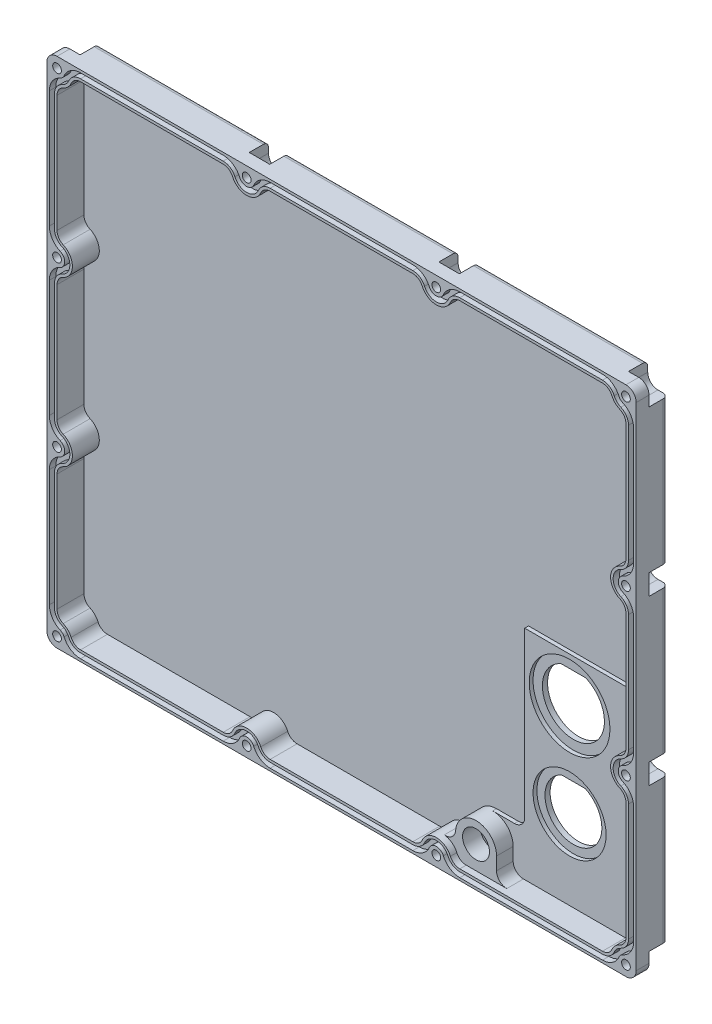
from build123d import *

# Parameters (mm, degrees)
SKETCH_1_W             = 230
SKETCH_1_H             = 200
EXTRUDE_1_DEPTH        = 20
SKETCH_2_W             = 222
SKETCH_2_H             = 192
CUT_EXTRUDE_1_DEPTH    = 18
SKETCH_3_W             = 230
SKETCH_3_H             = 200
CUT_EXTRUDE_2_DEPTH    = 7.5
EXTRUDE_2_DEPTH        = 1.5
CUT_EXTRUDE_3_DEPTH    = 153.909286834
SKETCH_6_R             = 3.9
CUT_EXTRUDE_5_DEPTH    = 2
EXTRUDE_3_DEPTH        = 6.5
M12X1_51_D             = 10.5
M12X1_51_DEPTH         = 31.5
M12X1_51_TIP           = 3.15451825
CHAMFER_1_SIZE         = 1.85
CHAMFER_1_SIZE2        = 3.204293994
SKETCH_13_R            = 15.75
SKETCH_13_R_2          = 14.25
CUT_EXTRUDE_6_DEPTH    = 1.5
CUT_EXTRUDE_7_DEPTH    = 1
FILLET_1_R             = 4
EXTRUDE_4_DEPTH        = 10.5
CUT_EXTRUDE_START      = -2.5
CUT_EXTRUDE_8_DEPTH    = 2.5
SKETCH_18_R            = 1.7
CUT_EXTRUDE_9_DEPTH    = 153.909286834
CUT_EXTRUDE_10_DEPTH   = 7.5
SKETCH_20_R            = 5.1375
SKETCH_20_R_2          = 4.5125
CUT_EXTRUDE_11_DEPTH   = 0.1
CUT_EXTRUDE_11_2_DEPTH = 0.1
FILLET_2_R             = 2


with BuildPart() as part:
    # Sketch 1 → Extrude 1 (new body)
    with BuildSketch(Plane.XY):
        Rectangle(SKETCH_1_W, SKETCH_1_H)
    extrude(amount=-EXTRUDE_1_DEPTH)

    # Sketch 2 → Cut-Extrude 1 (cut)
    with BuildSketch(Plane.XY):
        Rectangle(SKETCH_2_W, SKETCH_2_H)
    extrude(amount=-CUT_EXTRUDE_1_DEPTH, mode=Mode.SUBTRACT)

    # Sketch 3 → Cut-Extrude 2 (cut)
    with BuildSketch(Plane.XY):
        Rectangle(SKETCH_3_W, SKETCH_3_H)
    extrude(amount=-CUT_EXTRUDE_2_DEPTH, mode=Mode.SUBTRACT)

    # Sketch 7 → Extrude 2 (add)
    with BuildSketch(Plane.XY.offset(-18)):
        with BuildLine():
            ThreePointArc((111, -7), (109.828427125, -9.828427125), (107, -11))
            Line((107, -11), (62.5, -11))
            Line((62.5, -11), (62.5, -75))
            ThreePointArc((62.5, -75), (61.328427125, -77.828427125), (58.5, -79))
            Line((58.5, -79), (50, -79))
            ThreePointArc((50, -79), (44.570708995, -81.124389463), (42.024900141, -86.369300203))
            ThreePointArc((42.024900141, -86.369300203), (40.59574926, -89.128782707), (37.622410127, -90.032370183))
            ThreePointArc((37.622410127, -90.032370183), (41.457267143, -91.983438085), (43, -96))
            Line((43, -96), (111, -96))
            Line((111, -96), (111, -7))
        make_face()
    extrude(amount=EXTRUDE_2_DEPTH)

    # Sketch 5 → Cut-Extrude 3 (cut, through all)
    with BuildSketch(Plane(origin=(0, 0, -20), x_dir=(-1, 0, 0), z_dir=(0, 0, -1))):
        with BuildLine():
            Line((-84.816637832, -17.4), (-75.183362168, -17.4))
            ThreePointArc((-75.183362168, -17.4), (-80, -40.6), (-84.816637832, -17.4))
        make_face()
        with BuildLine():
            Line((-84.604345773, -54.9), (-75.395654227, -54.9))
            ThreePointArc((-75.395654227, -54.9), (-80, -76.1), (-84.604345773, -54.9))
        make_face()
    extrude(amount=-CUT_EXTRUDE_3_DEPTH, mode=Mode.SUBTRACT)

    # Sketch 6 → Cut-Extrude 5 (cut)
    with BuildSketch(Plane(origin=(0, 0, -20), x_dir=(-1, 0, 0), z_dir=(0, 0, -1))):
        with Locations((-104, -65)):
            Circle(SKETCH_6_R)
    extrude(amount=-CUT_EXTRUDE_5_DEPTH, mode=Mode.SUBTRACT)

    # Sketch 9 → Extrude 3 (add)
    with BuildSketch(Plane.XY.offset(-16.5)):
        with BuildLine():
            Line((58, -87), (58, -92))
            ThreePointArc((58, -92), (59.171572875, -94.828427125), (62, -96))
            Line((62, -96), (43, -96))
            ThreePointArc((43, -96), (41.457267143, -91.983438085), (37.622410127, -90.032370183))
            ThreePointArc((37.622410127, -90.032370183), (40.59574926, -89.128782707), (42.024900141, -86.369300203))
            ThreePointArc((42.024900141, -86.369300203), (50.315595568, -79.006227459), (58, -87))
        make_face()
    extrude(amount=EXTRUDE_3_DEPTH)

    # M12x1_51
    with Locations(Plane(origin=(0, 0, -20), x_dir=(-1, 0, 0), z_dir=(0, 0, -1))):
        with Locations((-50, -87)):
            Hole(M12X1_51_D / 2, depth=M12X1_51_DEPTH)
            with Locations((0, 0, -(M12X1_51_DEPTH + M12X1_51_TIP / 2))):  # 118° drill point
                Cone(0, M12X1_51_D / 2, M12X1_51_TIP, mode=Mode.SUBTRACT)

    # Chamfer 1
    chamfer_1_edges = [part.edges().sort_by_distance(p)[0] for p in [
        (44.75, -87, -20),
    ]]
    chamfer_1_side = [part.faces().sort_by_distance(p)[0] for p in [
        (-1.68878208, 1.076147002, -20),
    ]]
    chamfer(chamfer_1_edges, length=CHAMFER_1_SIZE, length2=CHAMFER_1_SIZE2, reference=chamfer_1_side[0])

    # Sketch 13 → Cut-Extrude 6 (cut)
    with BuildSketch(Plane.XY.offset(-16.5)):
        with Locations((80, -28.5)):
            Circle(SKETCH_13_R)
        with Locations((80, -65)):
            Circle(SKETCH_13_R_2)
    extrude(amount=-CUT_EXTRUDE_6_DEPTH, mode=Mode.SUBTRACT)

    # Sketch 14 → Cut-Extrude 7 (cut)
    with BuildSketch(Plane(origin=(0, 0, -20), x_dir=(-1, 0, 0), z_dir=(0, 0, -1))):
        with BuildLine():
            Line((-102.7, -80.3), (-69.5, -80.3))
            ThreePointArc((-69.5, -80.3), (-68.439339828, -80.739339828), (-68, -81.8))
            Line((-68, -81.8), (-68, -95.5))
            ThreePointArc((-68, -95.5), (-68.439339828, -96.560660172), (-69.5, -97))
            Line((-69.5, -97), (-102.7, -97))
            ThreePointArc((-102.7, -97), (-103.760660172, -96.560660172), (-104.2, -95.5))
            Line((-104.2, -95.5), (-104.2, -81.8))
            ThreePointArc((-104.2, -81.8), (-103.760660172, -80.739339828), (-102.7, -80.3))
        make_face()
    extrude(amount=-CUT_EXTRUDE_7_DEPTH, mode=Mode.SUBTRACT)

    # Fillet 1
    fillet_1_edges = [part.edges().sort_by_distance(p)[0] for p in [
        (115, -100, -13.75),
        (-115, -100, -13.75),
        (-115, 100, -13.75),
        (115, 100, -13.75),
    ]]
    fillet(fillet_1_edges, radius=FILLET_1_R)

    # Sketch 15 → Extrude 4 (add)
    with BuildSketch(Plane.XY.offset(-18)):
        with BuildLine():
            Line((-46.16515139, 96), (-27.83484861, 96))
            ThreePointArc((-27.83484861, 96), (-30.02573884, 95.346640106), (-31.500909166, 93.6))
            ThreePointArc((-31.500909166, 93.6), (-37, 90), (-42.499090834, 93.6))
            ThreePointArc((-42.499090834, 93.6), (-43.97426116, 95.346640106), (-46.16515139, 96))
        make_face()
        with BuildLine():
            Line((27.83484861, 96), (46.16515139, 96))
            ThreePointArc((46.16515139, 96), (43.97426116, 95.346640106), (42.499090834, 93.6))
            ThreePointArc((42.499090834, 93.6), (37, 90), (31.500909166, 93.6))
            ThreePointArc((31.500909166, 93.6), (30.02573884, 95.346640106), (27.83484861, 96))
        make_face()
        with BuildLine():
            Line((101.83484861, 96), (111, 96))
            Line((111, 96), (111, 86.83484861))
            ThreePointArc((111, 86.83484861), (110.346640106, 89.02573884), (108.6, 90.500909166))
            ThreePointArc((108.6, 90.500909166), (106.757359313, 91.757359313), (105.500909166, 93.6))
            ThreePointArc((105.500909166, 93.6), (104.02573884, 95.346640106), (101.83484861, 96))
        make_face()
        with BuildLine():
            Line((-111, 96), (-111, 86.83484861))
            ThreePointArc((-111, 86.83484861), (-110.346640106, 89.02573884), (-108.6, 90.500909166))
            ThreePointArc((-108.6, 90.500909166), (-106.757359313, 91.757359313), (-105.500909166, 93.6))
            ThreePointArc((-105.500909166, 93.6), (-104.02573884, 95.346640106), (-101.83484861, 96))
            Line((-101.83484861, 96), (-111, 96))
        make_face()
        with BuildLine():
            Line((-111, -86.83484861), (-111, -96))
            Line((-111, -96), (-101.83484861, -96))
            ThreePointArc((-101.83484861, -96), (-104.02573884, -95.346640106), (-105.500909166, -93.6))
            ThreePointArc((-105.500909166, -93.6), (-106.757359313, -91.757359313), (-108.6, -90.500909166))
            ThreePointArc((-108.6, -90.500909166), (-110.346640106, -89.02573884), (-111, -86.83484861))
        make_face()
        with BuildLine():
            Line((111, -86.83484861), (111, -96))
            Line((111, -96), (101.83484861, -96))
            ThreePointArc((101.83484861, -96), (104.02573884, -95.346640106), (105.500909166, -93.6))
            ThreePointArc((105.500909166, -93.6), (106.757359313, -91.757359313), (108.6, -90.500909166))
            ThreePointArc((108.6, -90.500909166), (110.346640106, -89.02573884), (111, -86.83484861))
        make_face()
        with BuildLine():
            Line((-46.16515139, -96), (-27.83484861, -96))
            ThreePointArc((-27.83484861, -96), (-30.02573884, -95.346640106), (-31.500909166, -93.6))
            ThreePointArc((-31.500909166, -93.6), (-37, -90), (-42.499090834, -93.6))
            ThreePointArc((-42.499090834, -93.6), (-43.97426116, -95.346640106), (-46.16515139, -96))
        make_face()
        with BuildLine():
            Line((46.16515139, -96), (27.83484861, -96))
            ThreePointArc((27.83484861, -96), (30.02573884, -95.346640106), (31.500909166, -93.6))
            ThreePointArc((31.500909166, -93.6), (37, -90), (42.499090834, -93.6))
            ThreePointArc((42.499090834, -93.6), (43.97426116, -95.346640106), (46.16515139, -96))
        make_face()
        with BuildLine():
            Line((-111, 41.16515139), (-111, 22.83484861))
            ThreePointArc((-111, 22.83484861), (-110.346640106, 25.02573884), (-108.6, 26.500909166))
            ThreePointArc((-108.6, 26.500909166), (-105, 32), (-108.6, 37.499090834))
            ThreePointArc((-108.6, 37.499090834), (-110.346640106, 38.97426116), (-111, 41.16515139))
        make_face()
        with BuildLine():
            Line((-111, -22.83484861), (-111, -41.16515139))
            ThreePointArc((-111, -41.16515139), (-110.346640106, -38.97426116), (-108.6, -37.499090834))
            ThreePointArc((-108.6, -37.499090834), (-105, -32), (-108.6, -26.500909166))
            ThreePointArc((-108.6, -26.500909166), (-110.346640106, -25.02573884), (-111, -22.83484861))
        make_face()
        with BuildLine():
            Line((111, 41.16515139), (111, 22.83484861))
            ThreePointArc((111, 22.83484861), (110.346640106, 25.02573884), (108.6, 26.500909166))
            ThreePointArc((108.6, 26.500909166), (105, 32), (108.6, 37.499090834))
            ThreePointArc((108.6, 37.499090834), (110.346640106, 38.97426116), (111, 41.16515139))
        make_face()
        with BuildLine():
            Line((111, -22.83484861), (111, -41.16515139))
            ThreePointArc((111, -41.16515139), (110.346640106, -38.97426116), (108.6, -37.499090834))
            ThreePointArc((108.6, -37.499090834), (105, -32), (108.6, -26.500909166))
            ThreePointArc((108.6, -26.500909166), (110.346640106, -25.02573884), (111, -22.83484861))
        make_face()
    extrude(amount=EXTRUDE_4_DEPTH)

    # Sketch 16 → Cut-Extrude 8 (cut)
    # profile 1 of 2: a face of its own
    with BuildSketch(Plane.XY.offset(-7.5).offset(CUT_EXTRUDE_START)):
        with BuildLine():
            Line((101.83484861, -99), (46.16515139, -99))
            ThreePointArc((46.16515139, -99), (42.331093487, -97.856620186), (39.749545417, -94.8))
            ThreePointArc((39.749545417, -94.8), (37, -93), (34.250454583, -94.8))
            ThreePointArc((34.250454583, -94.8), (31.668906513, -97.856620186), (27.83484861, -99))
            Line((27.83484861, -99), (-27.83484861, -99))
            ThreePointArc((-27.83484861, -99), (-31.668906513, -97.856620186), (-34.250454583, -94.8))
            ThreePointArc((-34.250454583, -94.8), (-37, -93), (-39.749545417, -94.8))
            ThreePointArc((-39.749545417, -94.8), (-42.331093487, -97.856620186), (-46.16515139, -99))
            Line((-46.16515139, -99), (-101.83484861, -99))
            ThreePointArc((-101.83484861, -99), (-105.668906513, -97.856620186), (-108.250454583, -94.8))
            ThreePointArc((-108.250454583, -94.8), (-108.878679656, -93.878679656), (-109.8, -93.250454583))
            ThreePointArc((-109.8, -93.250454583), (-112.856620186, -90.668906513), (-114, -86.83484861))
            Line((-114, -86.83484861), (-114, -41.16515139))
            ThreePointArc((-114, -41.16515139), (-112.856620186, -37.331093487), (-109.8, -34.749545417))
            ThreePointArc((-109.8, -34.749545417), (-108, -32), (-109.8, -29.250454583))
            ThreePointArc((-109.8, -29.250454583), (-112.856620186, -26.668906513), (-114, -22.83484861))
            Line((-114, -22.83484861), (-114, 22.83484861))
            ThreePointArc((-114, 22.83484861), (-112.856620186, 26.668906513), (-109.8, 29.250454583))
            ThreePointArc((-109.8, 29.250454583), (-108, 32), (-109.8, 34.749545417))
            ThreePointArc((-109.8, 34.749545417), (-112.856620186, 37.331093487), (-114, 41.16515139))
            Line((-114, 41.16515139), (-114, 86.83484861))
            ThreePointArc((-114, 86.83484861), (-112.856620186, 90.668906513), (-109.8, 93.250454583))
            ThreePointArc((-109.8, 93.250454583), (-108.878679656, 93.878679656), (-108.250454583, 94.8))
            ThreePointArc((-108.250454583, 94.8), (-105.668906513, 97.856620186), (-101.83484861, 99))
            Line((-101.83484861, 99), (-46.16515139, 99))
            ThreePointArc((-46.16515139, 99), (-42.331093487, 97.856620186), (-39.749545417, 94.8))
            ThreePointArc((-39.749545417, 94.8), (-37, 93), (-34.250454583, 94.8))
            ThreePointArc((-34.250454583, 94.8), (-31.668906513, 97.856620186), (-27.83484861, 99))
            Line((-27.83484861, 99), (27.83484861, 99))
            ThreePointArc((27.83484861, 99), (31.668906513, 97.856620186), (34.250454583, 94.8))
            ThreePointArc((34.250454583, 94.8), (37, 93), (39.749545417, 94.8))
            ThreePointArc((39.749545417, 94.8), (42.331093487, 97.856620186), (46.16515139, 99))
            Line((46.16515139, 99), (101.83484861, 99))
            ThreePointArc((101.83484861, 99), (105.668906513, 97.856620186), (108.250454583, 94.8))
            ThreePointArc((108.250454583, 94.8), (108.878679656, 93.878679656), (109.8, 93.250454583))
            ThreePointArc((109.8, 93.250454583), (112.856620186, 90.668906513), (114, 86.83484861))
            Line((114, 86.83484861), (114, 41.16515139))
            ThreePointArc((114, 41.16515139), (112.856620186, 37.331093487), (109.8, 34.749545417))
            ThreePointArc((109.8, 34.749545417), (108, 32), (109.8, 29.250454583))
            ThreePointArc((109.8, 29.250454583), (112.856620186, 26.668906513), (114, 22.83484861))
            Line((114, 22.83484861), (114, -22.83484861))
            ThreePointArc((114, -22.83484861), (112.856620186, -26.668906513), (109.8, -29.250454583))
            ThreePointArc((109.8, -29.250454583), (108, -32), (109.8, -34.749545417))
            ThreePointArc((109.8, -34.749545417), (112.856620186, -37.331093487), (114, -41.16515139))
            Line((114, -41.16515139), (114, -86.83484861))
            ThreePointArc((114, -86.83484861), (112.856620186, -90.668906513), (109.8, -93.250454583))
            ThreePointArc((109.8, -93.250454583), (108.878679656, -93.878679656), (108.250454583, -94.8))
            ThreePointArc((108.250454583, -94.8), (105.668906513, -97.856620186), (101.83484861, -99))
        make_face()
        with BuildLine():
            Line((-112, -22.83484861), (-112, 22.83484861))
            ThreePointArc((-112, 22.83484861), (-111.183300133, 25.573461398), (-109, 27.417424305))
            ThreePointArc((-109, 27.417424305), (-106, 32), (-109, 36.582575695))
            ThreePointArc((-109, 36.582575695), (-111.183300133, 38.426538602), (-112, 41.16515139))
            Line((-112, 41.16515139), (-112, 86.83484861))
            ThreePointArc((-112, 86.83484861), (-111.183300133, 89.573461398), (-109, 91.417424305))
            ThreePointArc((-109, 91.417424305), (-107.464466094, 92.464466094), (-106.417424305, 94))
            ThreePointArc((-106.417424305, 94), (-104.573461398, 96.183300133), (-101.83484861, 97))
            Line((-101.83484861, 97), (-46.16515139, 97))
            ThreePointArc((-46.16515139, 97), (-43.426538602, 96.183300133), (-41.582575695, 94))
            ThreePointArc((-41.582575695, 94), (-37, 91), (-32.417424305, 94))
            ThreePointArc((-32.417424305, 94), (-30.573461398, 96.183300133), (-27.83484861, 97))
            Line((-27.83484861, 97), (27.83484861, 97))
            ThreePointArc((27.83484861, 97), (30.573461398, 96.183300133), (32.417424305, 94))
            ThreePointArc((32.417424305, 94), (37, 91), (41.582575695, 94))
            ThreePointArc((41.582575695, 94), (43.426538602, 96.183300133), (46.16515139, 97))
            Line((46.16515139, 97), (101.83484861, 97))
            ThreePointArc((101.83484861, 97), (104.573461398, 96.183300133), (106.417424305, 94))
            ThreePointArc((106.417424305, 94), (107.464466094, 92.464466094), (109, 91.417424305))
            ThreePointArc((109, 91.417424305), (111.183300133, 89.573461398), (112, 86.83484861))
            Line((112, 86.83484861), (112, 41.16515139))
            ThreePointArc((112, 41.16515139), (111.183300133, 38.426538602), (109, 36.582575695))
            ThreePointArc((109, 36.582575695), (106, 32), (109, 27.417424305))
            ThreePointArc((109, 27.417424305), (111.183300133, 25.573461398), (112, 22.83484861))
            Line((112, 22.83484861), (112, -22.83484861))
            ThreePointArc((112, -22.83484861), (111.183300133, -25.573461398), (109, -27.417424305))
            ThreePointArc((109, -27.417424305), (106, -32), (109, -36.582575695))
            ThreePointArc((109, -36.582575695), (111.183300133, -38.426538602), (112, -41.16515139))
            Line((112, -41.16515139), (112, -86.83484861))
            ThreePointArc((112, -86.83484861), (111.183300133, -89.573461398), (109, -91.417424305))
            ThreePointArc((109, -91.417424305), (107.464466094, -92.464466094), (106.417424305, -94))
            ThreePointArc((106.417424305, -94), (104.573461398, -96.183300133), (101.83484861, -97))
            Line((101.83484861, -97), (46.16515139, -97))
            ThreePointArc((46.16515139, -97), (43.426538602, -96.183300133), (41.582575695, -94))
            ThreePointArc((41.582575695, -94), (37, -91), (32.417424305, -94))
            ThreePointArc((32.417424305, -94), (30.573461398, -96.183300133), (27.83484861, -97))
            Line((27.83484861, -97), (-27.83484861, -97))
            ThreePointArc((-27.83484861, -97), (-30.573461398, -96.183300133), (-32.417424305, -94))
            ThreePointArc((-32.417424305, -94), (-37, -91), (-41.582575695, -94))
            ThreePointArc((-41.582575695, -94), (-43.426538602, -96.183300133), (-46.16515139, -97))
            Line((-46.16515139, -97), (-101.83484861, -97))
            ThreePointArc((-101.83484861, -97), (-104.573461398, -96.183300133), (-106.417424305, -94))
            ThreePointArc((-106.417424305, -94), (-107.464466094, -92.464466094), (-109, -91.417424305))
            ThreePointArc((-109, -91.417424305), (-111.183300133, -89.573461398), (-112, -86.83484861))
            Line((-112, -86.83484861), (-112, -41.16515139))
            ThreePointArc((-112, -41.16515139), (-111.183300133, -38.426538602), (-109, -36.582575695))
            ThreePointArc((-109, -36.582575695), (-106, -32), (-109, -27.417424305))
            ThreePointArc((-109, -27.417424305), (-111.183300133, -25.573461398), (-112, -22.83484861))
        make_face(mode=Mode.SUBTRACT)
    # profile 2 of 2: a face of its own
    with BuildSketch(Plane.XY.offset(-7.5).offset(CUT_EXTRUDE_START)):
        with BuildLine():
            Line((-46.16515139, -96), (-101.83484861, -96))
            ThreePointArc((-101.83484861, -96), (-104.02573884, -95.346640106), (-105.500909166, -93.6))
            ThreePointArc((-105.500909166, -93.6), (-106.757359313, -91.757359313), (-108.6, -90.500909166))
            ThreePointArc((-108.6, -90.500909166), (-110.346640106, -89.02573884), (-111, -86.83484861))
            Line((-111, -86.83484861), (-111, -41.16515139))
            ThreePointArc((-111, -41.16515139), (-110.346640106, -38.97426116), (-108.6, -37.499090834))
            ThreePointArc((-108.6, -37.499090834), (-105, -32), (-108.6, -26.500909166))
            ThreePointArc((-108.6, -26.500909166), (-110.346640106, -25.02573884), (-111, -22.83484861))
            Line((-111, -22.83484861), (-111, 22.83484861))
            ThreePointArc((-111, 22.83484861), (-110.346640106, 25.02573884), (-108.6, 26.500909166))
            ThreePointArc((-108.6, 26.500909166), (-105, 32), (-108.6, 37.499090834))
            ThreePointArc((-108.6, 37.499090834), (-110.346640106, 38.97426116), (-111, 41.16515139))
            Line((-111, 41.16515139), (-111, 86.83484861))
            ThreePointArc((-111, 86.83484861), (-110.346640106, 89.02573884), (-108.6, 90.500909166))
            ThreePointArc((-108.6, 90.500909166), (-106.757359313, 91.757359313), (-105.500909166, 93.6))
            ThreePointArc((-105.500909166, 93.6), (-104.02573884, 95.346640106), (-101.83484861, 96))
            Line((-101.83484861, 96), (-46.16515139, 96))
            ThreePointArc((-46.16515139, 96), (-43.97426116, 95.346640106), (-42.499090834, 93.6))
            ThreePointArc((-42.499090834, 93.6), (-37, 90), (-31.500909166, 93.6))
            ThreePointArc((-31.500909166, 93.6), (-30.02573884, 95.346640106), (-27.83484861, 96))
            Line((-27.83484861, 96), (27.83484861, 96))
            ThreePointArc((27.83484861, 96), (30.02573884, 95.346640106), (31.500909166, 93.6))
            ThreePointArc((31.500909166, 93.6), (37, 90), (42.499090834, 93.6))
            ThreePointArc((42.499090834, 93.6), (43.97426116, 95.346640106), (46.16515139, 96))
            Line((46.16515139, 96), (101.83484861, 96))
            ThreePointArc((101.83484861, 96), (104.02573884, 95.346640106), (105.500909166, 93.6))
            ThreePointArc((105.500909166, 93.6), (106.757359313, 91.757359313), (108.6, 90.500909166))
            ThreePointArc((108.6, 90.500909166), (110.346640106, 89.02573884), (111, 86.83484861))
            Line((111, 86.83484861), (111, 41.16515139))
            ThreePointArc((111, 41.16515139), (110.346640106, 38.97426116), (108.6, 37.499090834))
            ThreePointArc((108.6, 37.499090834), (105, 32), (108.6, 26.500909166))
            ThreePointArc((108.6, 26.500909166), (110.346640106, 25.02573884), (111, 22.83484861))
            Line((111, 22.83484861), (111, -22.83484861))
            ThreePointArc((111, -22.83484861), (110.346640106, -25.02573884), (108.6, -26.500909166))
            ThreePointArc((108.6, -26.500909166), (105, -32), (108.6, -37.499090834))
            ThreePointArc((108.6, -37.499090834), (110.346640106, -38.97426116), (111, -41.16515139))
            Line((111, -41.16515139), (111, -86.83484861))
            ThreePointArc((111, -86.83484861), (110.346640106, -89.02573884), (108.6, -90.500909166))
            ThreePointArc((108.6, -90.500909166), (106.757359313, -91.757359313), (105.500909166, -93.6))
            ThreePointArc((105.500909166, -93.6), (104.02573884, -95.346640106), (101.83484861, -96))
            Line((101.83484861, -96), (46.16515139, -96))
            ThreePointArc((46.16515139, -96), (43.97426116, -95.346640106), (42.499090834, -93.6))
            ThreePointArc((42.499090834, -93.6), (37, -90), (31.500909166, -93.6))
            ThreePointArc((31.500909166, -93.6), (30.02573884, -95.346640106), (27.83484861, -96))
            Line((27.83484861, -96), (-27.83484861, -96))
            ThreePointArc((-27.83484861, -96), (-30.02573884, -95.346640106), (-31.500909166, -93.6))
            ThreePointArc((-31.500909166, -93.6), (-37, -90), (-42.499090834, -93.6))
            ThreePointArc((-42.499090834, -93.6), (-43.97426116, -95.346640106), (-46.16515139, -96))
        make_face()
    extrude(amount=CUT_EXTRUDE_8_DEPTH, mode=Mode.SUBTRACT)

    # Sketch 18 → Cut-Extrude 9 (cut, through all)
    with BuildSketch(Plane.XY.offset(-7.5)):
        with Locations((-111, 96)):
            Circle(SKETCH_18_R)
        with Locations((-37, 96)):
            Circle(SKETCH_18_R)
        with Locations((37, 96)):
            Circle(SKETCH_18_R)
        with Locations((111, 96)):
            Circle(SKETCH_18_R)
        with Locations((111, 32)):
            Circle(SKETCH_18_R)
        with Locations((111, -32)):
            Circle(SKETCH_18_R)
        with Locations((111, -96)):
            Circle(SKETCH_18_R)
        with Locations((37, -96)):
            Circle(SKETCH_18_R)
        with Locations((-37, -96)):
            Circle(SKETCH_18_R)
        with Locations((-111, -96)):
            Circle(SKETCH_18_R)
        with Locations((-111, -32)):
            Circle(SKETCH_18_R)
        with Locations((-111, 32)):
            Circle(SKETCH_18_R)
    extrude(amount=-CUT_EXTRUDE_9_DEPTH, mode=Mode.SUBTRACT)

    # Sketch 19 → Cut-Extrude 10 (cut)
    with BuildSketch(Plane(origin=(0, 0, -20), x_dir=(-1, 0, 0), z_dir=(0, 0, -1))):
        with BuildLine():
            Line((41, -96), (41, -100))
            Line((41, -100), (33, -100))
            Line((33, -100), (33, -96))
            ThreePointArc((33, -96), (37, -92), (41, -96))
        make_face()
        with BuildLine():
            Line((-33, -96), (-33, -100))
            Line((-33, -100), (-41, -100))
            Line((-41, -100), (-41, -96))
            ThreePointArc((-41, -96), (-37, -92), (-33, -96))
        make_face()
        with BuildLine():
            Line((-111, -36), (-115, -36))
            Line((-115, -36), (-115, -28))
            Line((-115, -28), (-111, -28))
            ThreePointArc((-111, -28), (-107, -32), (-111, -36))
        make_face()
        with BuildLine():
            Line((-111, 28), (-115, 28))
            Line((-115, 28), (-115, 36))
            Line((-115, 36), (-111, 36))
            ThreePointArc((-111, 36), (-107, 32), (-111, 28))
        make_face()
        with BuildLine():
            Line((-33, 96), (-33, 100))
            Line((-33, 100), (-41, 100))
            Line((-41, 100), (-41, 96))
            ThreePointArc((-41, 96), (-37, 92), (-33, 96))
        make_face()
        with BuildLine():
            Line((41, 96), (41, 100))
            Line((41, 100), (33, 100))
            Line((33, 100), (33, 96))
            ThreePointArc((33, 96), (37, 92), (41, 96))
        make_face()
        with BuildLine():
            Line((111, 28), (115, 28))
            Line((115, 28), (115, 36))
            Line((115, 36), (111, 36))
            ThreePointArc((111, 36), (107, 32), (111, 28))
        make_face()
        with BuildLine():
            Line((111, -36), (115, -36))
            Line((115, -36), (115, -28))
            Line((115, -28), (111, -28))
            ThreePointArc((111, -28), (107, -32), (111, -36))
        make_face()
        with BuildLine():
            Line((115, -96), (115, -92))
            Line((115, -92), (111, -92))
            ThreePointArc((111, -92), (108.171572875, -93.171572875), (107, -96))
            Line((107, -96), (107, -100))
            Line((107, -100), (111, -100))
            ThreePointArc((111, -100), (113.828427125, -98.828427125), (115, -96))
        make_face()
        with BuildLine():
            Line((-111, -100), (-107, -100))
            Line((-107, -100), (-107, -96))
            ThreePointArc((-107, -96), (-108.171572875, -93.171572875), (-111, -92))
            Line((-111, -92), (-115, -92))
            Line((-115, -92), (-115, -96))
            ThreePointArc((-115, -96), (-113.828427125, -98.828427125), (-111, -100))
        make_face()
        with BuildLine():
            Line((-115, 96), (-115, 92))
            Line((-115, 92), (-111, 92))
            ThreePointArc((-111, 92), (-108.171572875, 93.171572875), (-107, 96))
            Line((-107, 96), (-107, 100))
            Line((-107, 100), (-111, 100))
            ThreePointArc((-111, 100), (-113.828427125, 98.828427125), (-115, 96))
        make_face()
        with BuildLine():
            Line((115, 96), (115, 92))
            Line((115, 92), (111, 92))
            ThreePointArc((111, 92), (108.171572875, 93.171572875), (107, 96))
            Line((107, 96), (107, 100))
            Line((107, 100), (111, 100))
            ThreePointArc((111, 100), (113.828427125, 98.828427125), (115, 96))
        make_face()
    extrude(amount=-CUT_EXTRUDE_10_DEPTH, mode=Mode.SUBTRACT)

    # Sketch 20 → Cut-Extrude 11 (cut)
    # profile 1 of 4: a face of its own
    with BuildSketch(Plane(origin=(0, 0, -20), x_dir=(-1, 0, 0), z_dir=(0, 0, -1))):
        with Locations((-104, -51)):
            Circle(SKETCH_20_R)
        with Locations((-104, -51)):
            Circle(SKETCH_20_R_2, mode=Mode.SUBTRACT)
    # profile 2 of 4: a face of its own
    with BuildSketch(Plane(origin=(0, 0, -20), x_dir=(-1, 0, 0), z_dir=(0, 0, -1))):
        with BuildLine():
            Line((-104.95, -54.115), (-103.05, -54.115))
            ThreePointArc((-103.05, -54.115), (-102.74, -54.425), (-103.05, -54.735))
            Line((-103.05, -54.735), (-104.95, -54.735))
            ThreePointArc((-104.95, -54.735), (-105.26, -54.425), (-104.95, -54.115))
        make_face()
    # profile 3 of 4: a face of its own
    with BuildSketch(Plane(origin=(0, 0, -20), x_dir=(-1, 0, 0), z_dir=(0, 0, -1))):
        with BuildLine():
            ThreePointArc((-101.8, -52.865), (-101.49, -53.175), (-101.8, -53.485))
            Line((-101.8, -53.485), (-106.2, -53.485))
            ThreePointArc((-106.2, -53.485), (-106.51, -53.175), (-106.2, -52.865))
            Line((-106.2, -52.865), (-101.8, -52.865))
        make_face()
    # profile 4 of 4: a face of its own
    with BuildSketch(Plane(origin=(0, 0, -20), x_dir=(-1, 0, 0), z_dir=(0, 0, -1))):
        with BuildLine():
            Line((-104.31, -51.64), (-107.45, -51.64))
            ThreePointArc((-107.45, -51.64), (-107.76, -51.95), (-107.45, -52.26))
            Line((-107.45, -52.26), (-100.55, -52.26))
            ThreePointArc((-100.55, -52.26), (-100.24, -51.95), (-100.55, -51.64))
            Line((-100.55, -51.64), (-103.69, -51.64))
            Line((-103.69, -51.64), (-103.69, -47.575))
            ThreePointArc((-103.69, -47.575), (-104, -47.265), (-104.31, -47.575))
            Line((-104.31, -47.575), (-104.31, -51.64))
        make_face()
    extrude(amount=-CUT_EXTRUDE_11_DEPTH, mode=Mode.SUBTRACT)

    # Sketch 21 → Cut-Extrude 11 2 (cut)
    # profile 1 of 15: a face of its own
    with BuildSketch(Plane(origin=(0, 0, -20), x_dir=(-1, 0, 0), z_dir=(0, 0, -1))):
        with BuildLine():
            add(Edge.make_bspline(
                [(-106.247969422, -75.494027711), (-106.270386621, -75.468650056), (-106.3195684, -75.412973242), (-106.397227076, -75.319369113), (-106.485218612, -75.208339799), (-106.58414077, -75.080051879), (-106.695841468, -74.936186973), (-106.815625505, -74.772889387), (-106.948570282, -74.59428318), (-107.040006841, -74.468867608), (-107.087673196, -74.403487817)],
                knots=[0, 0, 0, 0, 0.590219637, 1.294900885, 2.119757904, 3.059611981, 4.118790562, 5.294507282, 6.589612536, 8, 8, 8, 8], degree=3))
            add(Edge.make_bspline(
                [(-107.087673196, -74.403487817), (-107.139591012, -74.331933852), (-107.236984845, -74.197704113), (-107.371594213, -74.007266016), (-107.484585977, -73.840451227), (-107.578002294, -73.698767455), (-107.651291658, -73.581350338), (-107.701624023, -73.487391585), (-107.73711399, -73.418624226), (-107.745150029, -73.378416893), (-107.748208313, -73.363115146)],
                knots=[0, 0, 0, 0, 1.715454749, 3.218061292, 4.525220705, 5.624516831, 6.512303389, 7.207215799, 7.698289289, 8, 8, 8, 8], degree=3))
            add(Edge.make_bspline(
                [(-107.748208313, -73.363115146), (-107.746963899, -73.338631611), (-107.744480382, -73.289769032), (-107.720276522, -73.22009185), (-107.683844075, -73.154645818), (-107.632448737, -73.097570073), (-107.572214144, -73.048644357), (-107.505196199, -73.012161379), (-107.43251477, -72.991122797), (-107.382835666, -72.98829582), (-107.35762064, -72.986860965)],
                knots=[0, 0, 0, 0, 0.976661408, 1.949154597, 2.919556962, 3.958323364, 5.000993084, 6.013269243, 6.991618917, 8, 8, 8, 8], degree=3))
            add(Edge.make_bspline(
                [(-107.35762064, -72.986860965), (-107.327865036, -72.988470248), (-107.269520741, -72.991625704), (-107.186651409, -73.023783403), (-107.111921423, -73.07514981), (-107.071583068, -73.121608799), (-107.050645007, -73.145723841)],
                knots=[0, 0, 0, 0, 0.992629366, 1.946331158, 2.934020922, 4, 4, 4, 4], degree=3))
            Line((-107.050645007, -73.145723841), (-105.736741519, -74.839464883))
            Line((-105.736741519, -74.839464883), (-104.421643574, -73.145723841))
            add(Edge.make_bspline(
                [(-104.421643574, -73.145723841), (-104.401187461, -73.121515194), (-104.361400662, -73.074429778), (-104.285492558, -73.023827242), (-104.201560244, -72.991606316), (-104.142435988, -72.988463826), (-104.112279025, -72.986860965)],
                knots=[0, 0, 0, 0, 1.049592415, 2.041439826, 3.001015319, 4, 4, 4, 4], degree=3))
            add(Edge.make_bspline(
                [(-104.112279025, -72.986860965), (-104.087084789, -72.988331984), (-104.037446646, -72.991230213), (-103.965142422, -73.011549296), (-103.89981724, -73.049510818), (-103.839596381, -73.097012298), (-103.79008505, -73.155485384), (-103.751366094, -73.219432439), (-103.729451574, -73.290065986), (-103.726671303, -73.338690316), (-103.725274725, -73.363115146)],
                knots=[0, 0, 0, 0, 1.01285163, 1.99553871, 2.984202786, 4.031495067, 5.064380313, 6.047067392, 7.019008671, 8, 8, 8, 8], degree=3))
            add(Edge.make_bspline(
                [(-103.725274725, -73.363115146), (-103.728123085, -73.383214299), (-103.735000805, -73.431746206), (-103.769989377, -73.511854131), (-103.8232512, -73.612307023), (-103.897671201, -73.733241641), (-103.993090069, -73.874613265), (-104.108535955, -74.036680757), (-104.24695127, -74.218000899), (-104.346273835, -74.345451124), (-104.398948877, -74.413043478)],
                knots=[0, 0, 0, 0, 0.386432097, 0.93308839, 1.654374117, 2.562312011, 3.642447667, 4.913080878, 6.362873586, 8, 8, 8, 8], degree=3))
            add(Edge.make_bspline(
                [(-104.398948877, -74.413043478), (-104.541018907, -74.587491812), (-104.825671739, -74.937018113), (-105.111172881, -75.285851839), (-105.254180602, -75.460582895)],
                knots=[0, 0, 0, 0, 0.998198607, 2, 2, 2, 2], degree=3))
            add(Edge.make_bspline(
                [(-105.254180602, -75.460582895), (-105.106875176, -75.641353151), (-104.811910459, -76.003327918), (-104.516813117, -76.36519457), (-104.369087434, -76.546344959)],
                knots=[0, 0, 0, 0, 0.998800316, 2, 2, 2, 2], degree=3))
            add(Edge.make_bspline(
                [(-104.369087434, -76.546344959), (-104.31439629, -76.616705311), (-104.211373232, -76.74924484), (-104.068137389, -76.937998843), (-103.948531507, -77.106048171), (-103.847825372, -77.25044977), (-103.770663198, -77.37395322), (-103.717261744, -77.476343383), (-103.678701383, -77.555491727), (-103.671901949, -77.604005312), (-103.669135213, -77.623745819)],
                knots=[0, 0, 0, 0, 1.654100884, 3.11587065, 4.397626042, 5.481986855, 6.384429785, 7.095189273, 7.631826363, 8, 8, 8, 8], degree=3))
            add(Edge.make_bspline(
                [(-103.669135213, -77.623745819), (-103.670321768, -77.649027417), (-103.672652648, -77.69869085), (-103.697220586, -77.770309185), (-103.735765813, -77.836511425), (-103.788491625, -77.895136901), (-103.849033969, -77.945480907), (-103.917810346, -77.980317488), (-103.990189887, -78.00319625), (-104.040441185, -78.005838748), (-104.065695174, -78.007166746)],
                knots=[0, 0, 0, 0, 0.991955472, 1.948607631, 2.945997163, 3.989963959, 5.037689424, 6.026171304, 7.008044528, 8, 8, 8, 8], degree=3))
            add(Edge.make_bspline(
                [(-104.065695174, -78.007166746), (-104.093438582, -78.005394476), (-104.148481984, -78.001878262), (-104.226831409, -77.971348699), (-104.298321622, -77.922451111), (-104.336226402, -77.877608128), (-104.355948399, -77.854276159)],
                knots=[0, 0, 0, 0, 0.975970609, 1.936342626, 2.926271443, 4, 4, 4, 4], degree=3))
            Line((-104.355948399, -77.854276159), (-105.736741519, -76.081700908))
            Line((-105.736741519, -76.081700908), (-107.113951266, -77.854276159))
            add(Edge.make_bspline(
                [(-107.113951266, -77.854276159), (-107.133673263, -77.877608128), (-107.171578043, -77.922451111), (-107.243068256, -77.971348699), (-107.321417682, -78.001878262), (-107.376461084, -78.005394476), (-107.404204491, -78.007166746)],
                knots=[0, 0, 0, 0, 1.073728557, 2.063657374, 3.024029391, 4, 4, 4, 4], degree=3))
            add(Edge.make_bspline(
                [(-107.404204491, -78.007166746), (-107.429458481, -78.005838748), (-107.479709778, -78.00319625), (-107.552089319, -77.980317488), (-107.620865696, -77.945480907), (-107.681408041, -77.895136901), (-107.734133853, -77.836511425), (-107.772679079, -77.770309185), (-107.797247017, -77.69869085), (-107.799577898, -77.649027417), (-107.800764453, -77.623745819)],
                knots=[0, 0, 0, 0, 0.991955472, 1.973828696, 2.962310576, 4.010036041, 5.054002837, 6.051392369, 7.008044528, 8, 8, 8, 8], degree=3))
            add(Edge.make_bspline(
                [(-107.800764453, -77.623745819), (-107.797892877, -77.604440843), (-107.790773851, -77.556581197), (-107.754597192, -77.477432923), (-107.700024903, -77.376751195), (-107.624607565, -77.254256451), (-107.526842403, -77.111416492), (-107.409822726, -76.945904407), (-107.269616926, -76.760132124), (-107.167899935, -76.629802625), (-107.113951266, -76.560678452)],
                knots=[0, 0, 0, 0, 0.366374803, 0.908292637, 1.623197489, 2.528993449, 3.615137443, 4.884917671, 6.347822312, 8, 8, 8, 8], degree=3))
            add(Edge.make_bspline(
                [(-107.113951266, -76.560678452), (-106.969831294, -76.383093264), (-106.681238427, -76.027488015), (-106.39251012, -75.671992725), (-106.247969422, -75.494027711)],
                knots=[0, 0, 0, 0, 0.99877709, 2, 2, 2, 2], degree=3))
        make_face()
    # profile 2 of 15: a face of its own
    with BuildSketch(Plane(origin=(0, 0, -20), x_dir=(-1, 0, 0), z_dir=(0, 0, -1))):
        with BuildLine():
            Line((-103.02173913, -74.872909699), (-101.129718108, -73.106306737))
            add(Edge.make_bspline(
                [(-101.129718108, -73.106306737), (-101.103318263, -73.083103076), (-101.053533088, -73.039345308), (-100.972462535, -72.990858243), (-100.892277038, -72.959402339), (-100.838123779, -72.955364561), (-100.811992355, -72.953416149)],
                knots=[0, 0, 0, 0, 1.167378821, 2.201458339, 3.132121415, 4, 4, 4, 4], degree=3))
            add(Edge.make_bspline(
                [(-100.811992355, -72.953416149), (-100.786812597, -72.954893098), (-100.738842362, -72.957706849), (-100.670424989, -72.976287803), (-100.613577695, -73.012194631), (-100.565901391, -73.060339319), (-100.532008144, -73.123229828), (-100.506622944, -73.198227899), (-100.491587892, -73.286481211), (-100.49021425, -73.349917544), (-100.489488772, -73.383420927)],
                knots=[0, 0, 0, 0, 0.987567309, 1.881425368, 2.74324298, 3.592966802, 4.508493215, 5.515231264, 6.687689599, 8, 8, 8, 8], degree=3))
            Line((-100.489488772, -73.383420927), (-100.489488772, -77.620162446))
            add(Edge.make_bspline(
                [(-100.489488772, -77.620162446), (-100.490428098, -77.65014161), (-100.492188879, -77.70633804), (-100.510540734, -77.784857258), (-100.53969002, -77.852049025), (-100.583421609, -77.906557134), (-100.638484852, -77.949451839), (-100.706129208, -77.979229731), (-100.785191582, -77.997140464), (-100.841750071, -77.999009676), (-100.871715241, -78)],
                knots=[0, 0, 0, 0, 1.163483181, 2.18096819, 3.116120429, 3.986378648, 4.868803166, 5.803955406, 6.836516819, 8, 8, 8, 8], degree=3))
            add(Edge.make_bspline(
                [(-100.871715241, -78), (-100.901696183, -77.999062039), (-100.957895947, -77.997303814), (-101.036393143, -77.978935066), (-101.103658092, -77.949841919), (-101.157668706, -77.906115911), (-101.201394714, -77.852105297), (-101.230487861, -77.784840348), (-101.248856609, -77.706343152), (-101.250614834, -77.650143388), (-101.251552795, -77.620162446)],
                knots=[0, 0, 0, 0, 1.167458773, 2.188420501, 3.126768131, 4, 4.873231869, 5.811579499, 6.832541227, 8, 8, 8, 8], degree=3))
            Line((-101.251552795, -77.620162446), (-101.251552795, -74.257763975))
            Line((-101.251552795, -74.257763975), (-102.499761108, -75.430721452))
            add(Edge.make_bspline(
                [(-102.499761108, -75.430721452), (-102.51906375, -75.447502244), (-102.556436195, -75.479992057), (-102.621807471, -75.513846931), (-102.690357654, -75.535023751), (-102.737707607, -75.537954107), (-102.761347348, -75.539417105)],
                knots=[0, 0, 0, 0, 1.055061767, 2.042737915, 3.022825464, 4, 4, 4, 4], degree=3))
            add(Edge.make_bspline(
                [(-102.761347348, -75.539417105), (-102.786609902, -75.538178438), (-102.836615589, -75.535726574), (-102.908327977, -75.511814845), (-102.974253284, -75.473293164), (-103.034380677, -75.422965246), (-103.083953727, -75.361464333), (-103.120322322, -75.29381814), (-103.143259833, -75.221553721), (-103.145847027, -75.171691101), (-103.147157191, -75.146440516)],
                knots=[0, 0, 0, 0, 0.993515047, 1.966602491, 2.944112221, 3.991369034, 5.040741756, 6.038094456, 7.006484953, 8, 8, 8, 8], degree=3))
            add(Edge.make_bspline(
                [(-103.147157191, -75.146440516), (-103.145420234, -75.121179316), (-103.141984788, -75.071216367), (-103.118055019, -74.998514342), (-103.078373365, -74.930584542), (-103.040960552, -74.892484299), (-103.02173913, -74.872909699)],
                knots=[0, 0, 0, 0, 0.978764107, 1.935851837, 2.939511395, 4, 4, 4, 4], degree=3))
        make_face()
    # profile 3 of 15: a face of its own
    with BuildSketch(Plane(origin=(0, 0, -20), x_dir=(-1, 0, 0), z_dir=(0, 0, -1))):
        with BuildLine():
            add(Edge.make_bspline(
                [(-60.196368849, -23.994027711), (-60.218786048, -23.968650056), (-60.267967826, -23.912973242), (-60.345626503, -23.819369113), (-60.433618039, -23.708339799), (-60.532540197, -23.580051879), (-60.644240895, -23.436186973), (-60.764024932, -23.272889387), (-60.896969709, -23.09428318), (-60.988406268, -22.968867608), (-61.036072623, -22.903487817)],
                knots=[0, 0, 0, 0, 0.590219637, 1.294900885, 2.119757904, 3.059611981, 4.118790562, 5.294507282, 6.589612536, 8, 8, 8, 8], degree=3))
            add(Edge.make_bspline(
                [(-61.036072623, -22.903487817), (-61.087990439, -22.831933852), (-61.185384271, -22.697704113), (-61.31999364, -22.507266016), (-61.432985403, -22.340451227), (-61.52640172, -22.198767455), (-61.599691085, -22.081350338), (-61.65002345, -21.987391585), (-61.685513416, -21.918624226), (-61.693549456, -21.878416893), (-61.69660774, -21.863115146)],
                knots=[0, 0, 0, 0, 1.715454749, 3.218061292, 4.525220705, 5.624516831, 6.512303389, 7.207215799, 7.698289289, 8, 8, 8, 8], degree=3))
            add(Edge.make_bspline(
                [(-61.69660774, -21.863115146), (-61.695363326, -21.838631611), (-61.692879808, -21.789769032), (-61.668675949, -21.72009185), (-61.632243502, -21.654645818), (-61.580848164, -21.597570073), (-61.520613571, -21.548644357), (-61.453595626, -21.512161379), (-61.380914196, -21.491122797), (-61.331235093, -21.48829582), (-61.306020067, -21.486860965)],
                knots=[0, 0, 0, 0, 0.976661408, 1.949154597, 2.919556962, 3.958323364, 5.000993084, 6.013269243, 6.991618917, 8, 8, 8, 8], degree=3))
            add(Edge.make_bspline(
                [(-61.306020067, -21.486860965), (-61.276264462, -21.488470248), (-61.217920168, -21.491625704), (-61.135050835, -21.523783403), (-61.06032085, -21.57514981), (-61.019982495, -21.621608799), (-60.999044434, -21.645723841)],
                knots=[0, 0, 0, 0, 0.992629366, 1.946331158, 2.934020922, 4, 4, 4, 4], degree=3))
            Line((-60.999044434, -21.645723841), (-59.685140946, -23.339464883))
            Line((-59.685140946, -23.339464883), (-58.370043, -21.645723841))
            add(Edge.make_bspline(
                [(-58.370043, -21.645723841), (-58.349586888, -21.621515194), (-58.309800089, -21.574429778), (-58.233891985, -21.523827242), (-58.149959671, -21.491606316), (-58.090835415, -21.488463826), (-58.060678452, -21.486860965)],
                knots=[0, 0, 0, 0, 1.049592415, 2.041439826, 3.001015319, 4, 4, 4, 4], degree=3))
            add(Edge.make_bspline(
                [(-58.060678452, -21.486860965), (-58.035484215, -21.488331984), (-57.985846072, -21.491230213), (-57.913541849, -21.511549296), (-57.848216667, -21.549510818), (-57.787995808, -21.597012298), (-57.738484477, -21.655485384), (-57.699765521, -21.719432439), (-57.677851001, -21.790065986), (-57.67507073, -21.838690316), (-57.673674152, -21.863115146)],
                knots=[0, 0, 0, 0, 1.01285163, 1.99553871, 2.984202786, 4.031495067, 5.064380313, 6.047067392, 7.019008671, 8, 8, 8, 8], degree=3))
            add(Edge.make_bspline(
                [(-57.673674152, -21.863115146), (-57.676522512, -21.883214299), (-57.683400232, -21.931746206), (-57.718388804, -22.011854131), (-57.771650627, -22.112307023), (-57.846070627, -22.233241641), (-57.941489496, -22.374613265), (-58.056935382, -22.536680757), (-58.195350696, -22.718000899), (-58.294673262, -22.845451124), (-58.347348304, -22.913043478)],
                knots=[0, 0, 0, 0, 0.386432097, 0.93308839, 1.654374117, 2.562312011, 3.642447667, 4.913080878, 6.362873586, 8, 8, 8, 8], degree=3))
            add(Edge.make_bspline(
                [(-58.347348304, -22.913043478), (-58.489418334, -23.087491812), (-58.774071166, -23.437018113), (-59.059572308, -23.785851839), (-59.202580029, -23.960582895)],
                knots=[0, 0, 0, 0, 0.998198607, 2, 2, 2, 2], degree=3))
            add(Edge.make_bspline(
                [(-59.202580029, -23.960582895), (-59.055274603, -24.141353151), (-58.760309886, -24.503327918), (-58.465212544, -24.86519457), (-58.317486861, -25.046344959)],
                knots=[0, 0, 0, 0, 0.998800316, 2, 2, 2, 2], degree=3))
            add(Edge.make_bspline(
                [(-58.317486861, -25.046344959), (-58.262795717, -25.116705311), (-58.159772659, -25.24924484), (-58.016536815, -25.437998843), (-57.896930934, -25.606048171), (-57.796224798, -25.75044977), (-57.719062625, -25.87395322), (-57.665661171, -25.976343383), (-57.62710081, -26.055491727), (-57.620301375, -26.104005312), (-57.617534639, -26.123745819)],
                knots=[0, 0, 0, 0, 1.654100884, 3.11587065, 4.397626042, 5.481986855, 6.384429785, 7.095189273, 7.631826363, 8, 8, 8, 8], degree=3))
            add(Edge.make_bspline(
                [(-57.617534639, -26.123745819), (-57.618721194, -26.149027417), (-57.621052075, -26.19869085), (-57.645620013, -26.270309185), (-57.68416524, -26.336511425), (-57.736891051, -26.395136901), (-57.797433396, -26.445480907), (-57.866209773, -26.480317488), (-57.938589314, -26.50319625), (-57.988840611, -26.505838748), (-58.014094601, -26.507166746)],
                knots=[0, 0, 0, 0, 0.991955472, 1.948607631, 2.945997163, 3.989963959, 5.037689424, 6.026171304, 7.008044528, 8, 8, 8, 8], degree=3))
            add(Edge.make_bspline(
                [(-58.014094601, -26.507166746), (-58.041838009, -26.505394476), (-58.096881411, -26.501878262), (-58.175230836, -26.471348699), (-58.246721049, -26.422451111), (-58.284625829, -26.377608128), (-58.304347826, -26.354276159)],
                knots=[0, 0, 0, 0, 0.975970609, 1.936342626, 2.926271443, 4, 4, 4, 4], degree=3))
            Line((-58.304347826, -26.354276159), (-59.685140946, -24.581700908))
            Line((-59.685140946, -24.581700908), (-61.062350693, -26.354276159))
            add(Edge.make_bspline(
                [(-61.062350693, -26.354276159), (-61.08207269, -26.377608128), (-61.11997747, -26.422451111), (-61.191467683, -26.471348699), (-61.269817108, -26.501878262), (-61.32486051, -26.505394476), (-61.352603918, -26.507166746)],
                knots=[0, 0, 0, 0, 1.073728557, 2.063657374, 3.024029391, 4, 4, 4, 4], degree=3))
            add(Edge.make_bspline(
                [(-61.352603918, -26.507166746), (-61.377857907, -26.505838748), (-61.428109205, -26.50319625), (-61.500488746, -26.480317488), (-61.569265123, -26.445480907), (-61.629807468, -26.395136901), (-61.682533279, -26.336511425), (-61.721078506, -26.270309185), (-61.745646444, -26.19869085), (-61.747977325, -26.149027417), (-61.74916388, -26.123745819)],
                knots=[0, 0, 0, 0, 0.991955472, 1.973828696, 2.962310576, 4.010036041, 5.054002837, 6.051392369, 7.008044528, 8, 8, 8, 8], degree=3))
            add(Edge.make_bspline(
                [(-61.74916388, -26.123745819), (-61.746292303, -26.104440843), (-61.739173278, -26.056581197), (-61.702996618, -25.977432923), (-61.648424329, -25.876751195), (-61.573006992, -25.754256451), (-61.47524183, -25.611416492), (-61.358222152, -25.445904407), (-61.218016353, -25.260132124), (-61.116299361, -25.129802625), (-61.062350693, -25.060678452)],
                knots=[0, 0, 0, 0, 0.366374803, 0.908292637, 1.623197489, 2.528993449, 3.615137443, 4.884917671, 6.347822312, 8, 8, 8, 8], degree=3))
            add(Edge.make_bspline(
                [(-61.062350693, -25.060678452), (-60.918230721, -24.883093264), (-60.629637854, -24.527488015), (-60.340909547, -24.171992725), (-60.196368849, -23.994027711)],
                knots=[0, 0, 0, 0, 0.99877709, 2, 2, 2, 2], degree=3))
        make_face()
    # profile 4 of 15: a face of its own
    with BuildSketch(Plane(origin=(0, 0, -20), x_dir=(-1, 0, 0), z_dir=(0, 0, -1))):
        with BuildLine():
            add(Edge.make_bspline(
                [(-53.298375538, -23.101767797), (-53.299756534, -23.156383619), (-53.302457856, -23.263215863), (-53.32354374, -23.41989715), (-53.356453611, -23.569683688), (-53.403988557, -23.712520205), (-53.467588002, -23.846819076), (-53.54078546, -23.975657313), (-53.630763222, -24.09586235), (-53.732553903, -24.207967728), (-53.844044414, -24.311157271), (-53.965491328, -24.399064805), (-54.092409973, -24.475622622), (-54.227944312, -24.53622642), (-54.369433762, -24.586028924), (-54.519507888, -24.618781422), (-54.675792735, -24.639609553), (-54.782620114, -24.642397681), (-54.836837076, -24.643812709)],
                knots=[0, 0, 0, 0, 1.074603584, 2.101997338, 3.105810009, 4.089602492, 5.057251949, 6.026328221, 7.00118536, 8.00536501, 9.003749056, 9.984916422, 10.95120051, 11.9155762, 12.901893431, 13.898060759, 14.933225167, 16, 16, 16, 16], degree=3))
            Line((-54.836837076, -24.643812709), (-56.223602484, -24.643812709))
            Line((-56.223602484, -24.643812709), (-56.223602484, -26.120162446))
            add(Edge.make_bspline(
                [(-56.223602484, -26.120162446), (-56.225131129, -26.14652877), (-56.228092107, -26.197600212), (-56.246773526, -26.271589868), (-56.282967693, -26.336510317), (-56.329178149, -26.394358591), (-56.38676174, -26.440963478), (-56.452564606, -26.475009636), (-56.525740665, -26.495993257), (-56.577020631, -26.498637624), (-56.603440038, -26.5)],
                knots=[0, 0, 0, 0, 1.054411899, 2.042390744, 3.017604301, 4.001603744, 4.985603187, 5.953390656, 6.945588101, 8, 8, 8, 8], degree=3))
            add(Edge.make_bspline(
                [(-56.603440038, -26.5), (-56.629866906, -26.498652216), (-56.681161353, -26.496036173), (-56.754577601, -26.474751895), (-56.821318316, -26.441054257), (-56.879828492, -26.394310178), (-56.927928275, -26.337258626), (-56.96181088, -26.270985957), (-56.982870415, -26.197875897), (-56.985504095, -26.14658664), (-56.986860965, -26.120162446)],
                knots=[0, 0, 0, 0, 1.050021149, 2.038086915, 3.015937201, 4.008186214, 4.998155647, 5.961913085, 6.949978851, 8, 8, 8, 8], degree=3))
            Line((-56.986860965, -26.120162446), (-56.986860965, -21.943143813))
            add(Edge.make_bspline(
                [(-56.986860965, -21.943143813), (-56.985496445, -21.918316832), (-56.982801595, -21.869284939), (-56.960792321, -21.798263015), (-56.921799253, -21.734071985), (-56.872533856, -21.675383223), (-56.814004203, -21.624702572), (-56.747184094, -21.590761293), (-56.677101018, -21.566940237), (-56.628328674, -21.564534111), (-56.603440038, -21.563306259)],
                knots=[0, 0, 0, 0, 0.998113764, 1.971218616, 2.955082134, 4.001422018, 5.047761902, 6.044073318, 7.001886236, 8, 8, 8, 8], degree=3))
            Line((-56.603440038, -21.563306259), (-54.836837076, -21.563306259))
            add(Edge.make_bspline(
                [(-54.836837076, -21.563306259), (-54.782624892, -21.564734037), (-54.675806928, -21.567547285), (-54.519453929, -21.588193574), (-54.369752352, -21.621577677), (-54.227320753, -21.668969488), (-54.0931226, -21.732107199), (-53.965093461, -21.80653264), (-53.844040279, -21.894831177), (-53.733032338, -21.99796306), (-53.629900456, -22.108971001), (-53.541601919, -22.230024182), (-53.467176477, -22.358053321), (-53.404038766, -22.492251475), (-53.356646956, -22.634683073), (-53.323262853, -22.784384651), (-53.302616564, -22.940737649), (-53.299803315, -23.047555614), (-53.298375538, -23.101767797)],
                knots=[0, 0, 0, 0, 1.067922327, 2.104200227, 3.1014391, 4.086289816, 5.054980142, 6.01831925, 7.000542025, 8, 8.999457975, 9.98168075, 10.945019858, 11.913710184, 12.8985609, 13.895799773, 14.932077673, 16, 16, 16, 16], degree=3))
        make_face()
        with BuildLine():
            add(Edge.make_bspline(
                [(-54.06043956, -23.101767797), (-54.062685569, -23.046161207), (-54.067033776, -22.938508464), (-54.108331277, -22.785945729), (-54.176924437, -22.650660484), (-54.270702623, -22.534634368), (-54.38572748, -22.438669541), (-54.52171066, -22.371528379), (-54.673880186, -22.329337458), (-54.781202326, -22.325151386), (-54.836837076, -22.322981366)],
                knots=[0, 0, 0, 0, 1.077260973, 2.085545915, 3.039189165, 4.000841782, 4.961376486, 5.921911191, 6.922739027, 8, 8, 8, 8], degree=3))
            Line((-54.836837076, -22.322981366), (-56.223602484, -22.322981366))
            Line((-56.223602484, -22.322981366), (-56.223602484, -23.881748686))
            Line((-56.223602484, -23.881748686), (-54.836837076, -23.881748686))
            add(Edge.make_bspline(
                [(-54.836837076, -23.881748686), (-54.781202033, -23.879578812), (-54.67387933, -23.875393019), (-54.521713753, -23.833200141), (-54.385716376, -23.766066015), (-54.270744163, -23.670075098), (-54.17654454, -23.553868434), (-54.108631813, -23.417832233), (-54.066976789, -23.26505566), (-54.062666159, -23.157384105), (-54.06043956, -23.101767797)],
                knots=[0, 0, 0, 0, 1.076333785, 2.076300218, 3.0360082, 3.995716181, 4.956541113, 5.916249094, 6.923666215, 8, 8, 8, 8], degree=3))
        make_face(mode=Mode.SUBTRACT)
    # profile 5 of 15: a face of its own
    with BuildSketch(Plane(origin=(0, 0, -20), x_dir=(-1, 0, 0), z_dir=(0, 0, -1))):
        with BuildLine():
            add(Edge.make_bspline(
                [(-52.612756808, -22.946488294), (-52.611319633, -22.896651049), (-52.608479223, -22.79815357), (-52.58778972, -22.653701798), (-52.554283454, -22.514747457), (-52.506877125, -22.381828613), (-52.443281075, -22.25591798), (-52.369469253, -22.134317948), (-52.280700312, -22.018752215), (-52.211792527, -21.948817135), (-52.176779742, -21.91328237)],
                knots=[0, 0, 0, 0, 1.03662462, 2.048767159, 3.029194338, 4.006537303, 4.977117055, 5.958803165, 6.962845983, 8, 8, 8, 8], degree=3))
            add(Edge.make_bspline(
                [(-52.176779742, -21.91328237), (-52.141212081, -21.87984835), (-52.070974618, -21.813824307), (-51.955634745, -21.729791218), (-51.836689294, -21.656735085), (-51.711962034, -21.598339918), (-51.582353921, -21.552453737), (-51.447730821, -21.520829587), (-51.308717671, -21.499066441), (-51.214132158, -21.497306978), (-51.166268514, -21.496416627)],
                knots=[0, 0, 0, 0, 1.042878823, 2.059431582, 3.044994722, 4.023768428, 4.998497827, 5.979342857, 6.977475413, 8, 8, 8, 8], degree=3))
            add(Edge.make_bspline(
                [(-51.166268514, -21.496416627), (-51.125188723, -21.497115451), (-51.042682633, -21.498518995), (-50.91986688, -21.516897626), (-50.79704669, -21.541762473), (-50.717707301, -21.568797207), (-50.677735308, -21.582417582)],
                knots=[0, 0, 0, 0, 0.987999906, 1.984333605, 2.984486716, 4, 4, 4, 4], degree=3))
            add(Edge.make_bspline(
                [(-50.677735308, -21.582417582), (-50.640778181, -21.595993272), (-50.567852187, -21.622781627), (-50.465065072, -21.675793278), (-50.366667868, -21.732531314), (-50.273886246, -21.797163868), (-50.188501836, -21.870926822), (-50.106110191, -21.949090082), (-50.032519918, -22.037178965), (-49.987380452, -22.099355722), (-49.964644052, -22.130673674)],
                knots=[0, 0, 0, 0, 1.031625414, 2.035664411, 3.027849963, 4.009928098, 4.995331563, 5.984875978, 6.984997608, 8, 8, 8, 8], degree=3))
            add(Edge.make_bspline(
                [(-49.964644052, -22.130673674), (-49.925946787, -22.192905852), (-49.84922611, -22.316286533), (-49.770832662, -22.520037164), (-49.722442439, -22.733576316), (-49.716708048, -22.879736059), (-49.713807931, -22.953655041)],
                knots=[0, 0, 0, 0, 1.005326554, 1.993146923, 2.985052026, 4, 4, 4, 4], degree=3))
            add(Edge.make_bspline(
                [(-49.713807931, -22.953655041), (-49.714586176, -22.995516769), (-49.716125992, -23.078343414), (-49.732635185, -23.20051591), (-49.757085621, -23.319445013), (-49.793734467, -23.434650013), (-49.838939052, -23.547023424), (-49.894139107, -23.656297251), (-49.959821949, -23.76208959), (-50.011396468, -23.828050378), (-50.037505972, -23.861442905)],
                knots=[0, 0, 0, 0, 1.021133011, 2.020390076, 3.003881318, 3.981304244, 4.966618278, 5.957523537, 6.966000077, 8, 8, 8, 8], degree=3))
            Line((-50.037505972, -23.861442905), (-51.506688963, -25.680602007))
            Line((-51.506688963, -25.680602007), (-50.020783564, -25.680602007))
            add(Edge.make_bspline(
                [(-50.020783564, -25.680602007), (-49.990817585, -25.68158143), (-49.93425757, -25.683430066), (-49.854849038, -25.701558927), (-49.787090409, -25.731025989), (-49.730494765, -25.772833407), (-49.687998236, -25.828529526), (-49.658322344, -25.89566522), (-49.640090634, -25.974288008), (-49.638311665, -26.030468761), (-49.637362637, -26.06043956)],
                knots=[0, 0, 0, 0, 1.161036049, 2.191425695, 3.138694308, 4.009865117, 4.890433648, 5.823618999, 6.838963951, 8, 8, 8, 8], degree=3))
            add(Edge.make_bspline(
                [(-49.637362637, -26.06043956), (-49.638301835, -26.090419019), (-49.640062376, -26.146616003), (-49.658415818, -26.225131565), (-49.68755983, -26.292335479), (-49.731309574, -26.346801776), (-49.786592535, -26.390081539), (-49.854931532, -26.419222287), (-49.934233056, -26.43747815), (-49.990809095, -26.439307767), (-50.020783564, -26.440277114)],
                knots=[0, 0, 0, 0, 1.161434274, 2.17712748, 3.110632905, 3.97935859, 4.860229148, 5.807822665, 6.838565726, 8, 8, 8, 8], degree=3))
            Line((-50.020783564, -26.440277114), (-52.305781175, -26.440277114))
            add(Edge.make_bspline(
                [(-52.305781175, -26.440277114), (-52.338511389, -26.439647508), (-52.399626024, -26.438471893), (-52.48487501, -26.422559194), (-52.557508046, -26.398155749), (-52.618258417, -26.363378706), (-52.665145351, -26.316690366), (-52.697760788, -26.25967395), (-52.719318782, -26.193337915), (-52.720715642, -26.145431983), (-52.721452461, -26.120162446)],
                knots=[0, 0, 0, 0, 1.31174639, 2.449324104, 3.465021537, 4.374780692, 5.233435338, 6.085673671, 6.990226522, 8, 8, 8, 8], degree=3))
            add(Edge.make_bspline(
                [(-52.721452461, -26.120162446), (-52.720079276, -26.094918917), (-52.71725749, -26.04304545), (-52.693205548, -25.966627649), (-52.655118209, -25.890795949), (-52.621049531, -25.843786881), (-52.603201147, -25.819159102)],
                knots=[0, 0, 0, 0, 0.918373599, 1.88718546, 2.893108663, 4, 4, 4, 4], degree=3))
            add(Edge.make_bspline(
                [(-52.603201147, -25.819159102), (-52.372728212, -25.549560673), (-51.911614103, -25.010167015), (-51.449810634, -24.471363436), (-51.218824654, -24.201863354)],
                knots=[0, 0, 0, 0, 0.999635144, 2, 2, 2, 2], degree=3))
            add(Edge.make_bspline(
                [(-51.218824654, -24.201863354), (-51.160495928, -24.128663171), (-51.048856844, -23.988560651), (-50.898749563, -23.781237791), (-50.771091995, -23.588624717), (-50.666588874, -23.410619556), (-50.583789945, -23.247211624), (-50.525987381, -23.097220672), (-50.48795917, -22.96148487), (-50.482155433, -22.874621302), (-50.479455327, -22.834209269)],
                knots=[0, 0, 0, 0, 1.424362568, 2.726178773, 3.89426454, 4.939812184, 5.866636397, 6.678031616, 7.38497311, 8, 8, 8, 8], degree=3))
            add(Edge.make_bspline(
                [(-50.479455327, -22.834209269), (-50.480780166, -22.804221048), (-50.48337768, -22.745425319), (-50.505370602, -22.660620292), (-50.542252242, -22.583085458), (-50.591565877, -22.510937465), (-50.657920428, -22.447584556), (-50.737152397, -22.390343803), (-50.830736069, -22.339467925), (-50.89954746, -22.31300837), (-50.935738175, -22.299092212)],
                knots=[0, 0, 0, 0, 0.951892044, 1.866305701, 2.760542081, 3.669513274, 4.626770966, 5.659242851, 6.768900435, 8, 8, 8, 8], degree=3))
            add(Edge.make_bspline(
                [(-50.935738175, -22.299092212), (-50.973273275, -22.287446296), (-51.048378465, -22.264143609), (-51.126959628, -22.26116507), (-51.166268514, -22.259675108)],
                knots=[0, 0, 0, 0, 0.999534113, 2, 2, 2, 2], degree=3))
            add(Edge.make_bspline(
                [(-51.166268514, -22.259675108), (-51.211185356, -22.26161846), (-51.299567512, -22.265442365), (-51.426282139, -22.306618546), (-51.544771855, -22.36910482), (-51.648772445, -22.457589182), (-51.738066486, -22.561483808), (-51.802178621, -22.680876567), (-51.84234026, -22.811765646), (-51.847072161, -22.903194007), (-51.849498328, -22.950071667)],
                knots=[0, 0, 0, 0, 0.996579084, 1.960952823, 2.936381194, 3.962206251, 4.98123222, 5.968665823, 6.958482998, 8, 8, 8, 8], degree=3))
            add(Edge.make_bspline(
                [(-51.849498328, -22.950071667), (-51.850485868, -22.979641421), (-51.852348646, -23.035418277), (-51.870267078, -23.113299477), (-51.900041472, -23.179832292), (-51.943450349, -23.233971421), (-51.99845869, -23.277567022), (-52.067393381, -23.304914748), (-52.146318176, -23.323643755), (-52.202927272, -23.325396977), (-52.232919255, -23.326325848)],
                knots=[0, 0, 0, 0, 1.151147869, 2.171388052, 3.094965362, 3.967580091, 4.852394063, 5.798008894, 6.833366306, 8, 8, 8, 8], degree=3))
            add(Edge.make_bspline(
                [(-52.232919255, -23.326325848), (-52.262900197, -23.325387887), (-52.319099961, -23.323629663), (-52.397597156, -23.305260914), (-52.464862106, -23.276167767), (-52.518872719, -23.232441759), (-52.562598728, -23.178431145), (-52.591691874, -23.111166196), (-52.610060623, -23.032669), (-52.611818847, -22.976469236), (-52.612756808, -22.946488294)],
                knots=[0, 0, 0, 0, 1.167458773, 2.188420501, 3.126768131, 4, 4.873231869, 5.811579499, 6.832541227, 8, 8, 8, 8], degree=3))
        make_face()
    # profile 6 of 15: a face of its own
    with BuildSketch(Plane(origin=(0, 0, -20), x_dir=(-1, 0, 0), z_dir=(0, 0, -1))):
        with BuildLine():
            Line((-59.737697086, -35.440277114), (-61.150740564, -35.440277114))
            add(Edge.make_bspline(
                [(-61.150740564, -35.440277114), (-61.175615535, -35.439000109), (-61.224742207, -35.436478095), (-61.29536061, -35.413094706), (-61.362529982, -35.378872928), (-61.420873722, -35.328120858), (-61.470963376, -35.26971386), (-61.507249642, -35.204282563), (-61.530400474, -35.134035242), (-61.532890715, -35.085306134), (-61.534161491, -35.06043956)],
                knots=[0, 0, 0, 0, 0.997367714, 1.96974521, 2.965311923, 4.01086971, 5.056427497, 6.045535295, 7.002632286, 8, 8, 8, 8], degree=3))
            Line((-61.534161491, -35.06043956), (-61.534161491, -30.943143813))
            add(Edge.make_bspline(
                [(-61.534161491, -30.943143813), (-61.532823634, -30.918301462), (-61.530181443, -30.869239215), (-61.507843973, -30.798632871), (-61.470527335, -30.73371259), (-61.420931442, -30.675432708), (-61.362515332, -30.624718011), (-61.295364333, -30.590486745), (-61.224741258, -30.567105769), (-61.175615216, -30.564583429), (-61.150740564, -30.563306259)],
                knots=[0, 0, 0, 0, 0.997203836, 1.96942156, 2.944403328, 3.989789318, 5.035175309, 6.03057844, 7.002796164, 8, 8, 8, 8], degree=3))
            Line((-61.150740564, -30.563306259), (-59.737697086, -30.563306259))
            add(Edge.make_bspline(
                [(-59.737697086, -30.563306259), (-59.660330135, -30.565644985), (-59.507989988, -30.570250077), (-59.285042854, -30.605289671), (-59.072581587, -30.664163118), (-58.871357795, -30.746888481), (-58.680656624, -30.852826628), (-58.502339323, -30.983287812), (-58.333065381, -31.135352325), (-58.233375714, -31.252474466), (-58.182513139, -31.312231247)],
                knots=[0, 0, 0, 0, 1.037689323, 2.043272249, 3.019189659, 3.989359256, 4.955446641, 5.938472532, 6.948189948, 8, 8, 8, 8], degree=3))
            add(Edge.make_bspline(
                [(-58.182513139, -31.312231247), (-58.137750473, -31.371264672), (-58.048908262, -31.488430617), (-57.933211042, -31.675681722), (-57.838143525, -31.873339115), (-57.757275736, -32.078089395), (-57.696663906, -32.292761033), (-57.652440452, -32.51515681), (-57.625499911, -32.746508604), (-57.622593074, -32.903574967), (-57.621118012, -32.983277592)],
                knots=[0, 0, 0, 0, 0.988484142, 1.961883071, 2.931561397, 3.912488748, 4.896462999, 5.904256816, 6.936524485, 8, 8, 8, 8], degree=3))
            add(Edge.make_bspline(
                [(-57.621118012, -32.983277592), (-57.622476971, -33.061802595), (-57.625169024, -33.217358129), (-57.654097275, -33.446515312), (-57.697701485, -33.66877589), (-57.760028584, -33.883449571), (-57.840708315, -34.090495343), (-57.937088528, -34.291074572), (-58.053910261, -34.483037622), (-58.143347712, -34.604017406), (-58.188485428, -34.665074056)],
                knots=[0, 0, 0, 0, 1.041304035, 2.062790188, 3.059401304, 4.044054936, 5.024064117, 6.004528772, 6.99291613, 8, 8, 8, 8], degree=3))
            add(Edge.make_bspline(
                [(-58.188485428, -34.665074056), (-58.240229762, -34.726696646), (-58.341456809, -34.84724845), (-58.510943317, -35.006082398), (-58.691562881, -35.139255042), (-58.880753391, -35.250406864), (-59.080928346, -35.336356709), (-59.291546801, -35.395029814), (-59.511293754, -35.434136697), (-59.661478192, -35.438209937), (-59.737697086, -35.440277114)],
                knots=[0, 0, 0, 0, 1.074342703, 2.101728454, 3.094320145, 4.066855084, 5.027225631, 5.995342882, 6.982632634, 8, 8, 8, 8], degree=3))
        make_face()
        with BuildLine():
            add(Edge.make_bspline(
                [(-59.737697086, -34.680602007), (-59.687406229, -34.679166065), (-59.588496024, -34.676341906), (-59.444068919, -34.648926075), (-59.306529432, -34.605666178), (-59.175752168, -34.546022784), (-59.052249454, -34.467793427), (-58.935350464, -34.373538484), (-58.825311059, -34.261064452), (-58.760533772, -34.176090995), (-58.727185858, -34.132345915)],
                knots=[0, 0, 0, 0, 1.007408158, 1.981333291, 2.935693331, 3.893020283, 4.854299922, 5.859174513, 6.897884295, 8, 8, 8, 8], degree=3))
            add(Edge.make_bspline(
                [(-58.727185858, -34.132345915), (-58.698162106, -34.091026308), (-58.640536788, -34.008988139), (-58.568025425, -33.87826684), (-58.507022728, -33.743336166), (-58.454992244, -33.60482666), (-58.415535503, -33.460884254), (-58.388499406, -33.312164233), (-58.37126138, -33.159265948), (-58.368863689, -33.055787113), (-58.367654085, -33.003583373)],
                knots=[0, 0, 0, 0, 1.005101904, 1.995583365, 2.971450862, 3.952459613, 4.939347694, 5.939400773, 6.960454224, 8, 8, 8, 8], degree=3))
            add(Edge.make_bspline(
                [(-58.367654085, -33.003583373), (-58.368882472, -32.952177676), (-58.371317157, -32.850290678), (-58.388329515, -32.699274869), (-58.41662522, -32.552132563), (-58.458235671, -32.409115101), (-58.508812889, -32.269211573), (-58.572839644, -32.134199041), (-58.647080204, -32.00251579), (-58.704990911, -31.919367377), (-58.734352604, -31.877209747)],
                knots=[0, 0, 0, 0, 1.023780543, 2.029151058, 3.022976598, 4.004448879, 4.992976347, 5.982775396, 6.977233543, 8, 8, 8, 8], degree=3))
            add(Edge.make_bspline(
                [(-58.734352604, -31.877209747), (-58.767609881, -31.832980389), (-58.832372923, -31.746851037), (-58.943651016, -31.634513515), (-59.059390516, -31.537739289), (-59.182707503, -31.459272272), (-59.31214792, -31.397617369), (-59.448509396, -31.354929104), (-59.59084734, -31.327186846), (-59.688193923, -31.324399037), (-59.737697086, -31.322981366)],
                knots=[0, 0, 0, 0, 1.111490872, 2.164444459, 3.171001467, 4.139264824, 5.095406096, 6.044821, 7.005742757, 8, 8, 8, 8], degree=3))
            Line((-59.737697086, -31.322981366), (-60.77090301, -31.322981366))
            Line((-60.77090301, -31.322981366), (-60.77090301, -34.680602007))
            Line((-60.77090301, -34.680602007), (-59.737697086, -34.680602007))
        make_face(mode=Mode.SUBTRACT)
    # profile 7 of 15: a face of its own
    with BuildSketch(Plane(origin=(0, 0, -20), x_dir=(-1, 0, 0), z_dir=(0, 0, -1))):
        with BuildLine():
            Line((-54.774725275, -34.294792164), (-53.32823698, -30.769947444))
            add(Edge.make_bspline(
                [(-53.32823698, -30.769947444), (-53.320082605, -30.750907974), (-53.304214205, -30.713857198), (-53.271409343, -30.66575828), (-53.236569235, -30.623098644), (-53.195425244, -30.590061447), (-53.150314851, -30.562696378), (-53.100487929, -30.544056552), (-53.046046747, -30.532835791), (-53.008578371, -30.531666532), (-52.989010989, -30.531055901)],
                knots=[0, 0, 0, 0, 1.116864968, 2.173417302, 3.135187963, 4.083133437, 5.009579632, 5.976872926, 6.943447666, 8, 8, 8, 8], degree=3))
            add(Edge.make_bspline(
                [(-52.989010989, -30.531055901), (-52.963784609, -30.532487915), (-52.91369986, -30.535331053), (-52.841187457, -30.556545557), (-52.772740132, -30.590336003), (-52.712306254, -30.638143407), (-52.658865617, -30.693337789), (-52.62034997, -30.757408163), (-52.595992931, -30.827567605), (-52.593645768, -30.876453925), (-52.592451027, -30.901337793)],
                knots=[0, 0, 0, 0, 1.007468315, 2.000239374, 2.996959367, 4.041357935, 5.066283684, 6.051881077, 7.008378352, 8, 8, 8, 8], degree=3))
            add(Edge.make_bspline(
                [(-52.592451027, -30.901337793), (-52.593568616, -30.909709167), (-52.596463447, -30.931393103), (-52.604638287, -30.970921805), (-52.623413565, -31.023359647), (-52.643211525, -31.09145133), (-52.673524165, -31.172259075), (-52.705631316, -31.268720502), (-52.748642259, -31.377339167), (-52.794673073, -31.501672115), (-52.848937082, -31.638931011), (-52.906574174, -31.791844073), (-52.974770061, -31.956884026), (-53.045062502, -32.137718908), (-53.125556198, -32.331027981), (-53.20735386, -32.540482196), (-53.300804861, -32.761959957), (-53.363055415, -32.91512024), (-53.395126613, -32.994027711)],
                knots=[0, 0, 0, 0, 0.180742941, 0.468169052, 0.861582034, 1.370879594, 1.985287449, 2.707455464, 3.54613214, 4.484526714, 5.544645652, 6.704471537, 7.981295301, 9.365707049, 10.856151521, 12.462064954, 14.177272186, 16, 16, 16, 16], degree=3))
            add(Edge.make_bspline(
                [(-53.395126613, -32.994027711), (-53.553277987, -33.372237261), (-53.869521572, -34.128514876), (-54.184747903, -34.885217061), (-54.342331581, -35.263497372)],
                knots=[0, 0, 0, 0, 1.000187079, 2, 2, 2, 2], degree=3))
            add(Edge.make_bspline(
                [(-54.342331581, -35.263497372), (-54.351143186, -35.282263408), (-54.368893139, -35.320065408), (-54.409165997, -35.368607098), (-54.457911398, -35.410866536), (-54.51839851, -35.442612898), (-54.58774062, -35.468804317), (-54.667152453, -35.487805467), (-54.756134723, -35.498108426), (-54.818495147, -35.499349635), (-54.851170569, -35.5)],
                knots=[0, 0, 0, 0, 0.830977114, 1.673906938, 2.514703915, 3.410736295, 4.40423903, 5.491906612, 6.685817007, 8, 8, 8, 8], degree=3))
            add(Edge.make_bspline(
                [(-54.851170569, -35.5), (-54.865609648, -35.498985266), (-54.897194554, -35.496765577), (-54.945766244, -35.479780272), (-54.998932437, -35.453789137), (-55.054952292, -35.420907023), (-55.107365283, -35.382335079), (-55.150704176, -35.342557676), (-55.185138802, -35.304840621), (-55.198521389, -35.276599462), (-55.204730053, -35.263497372)],
                knots=[0, 0, 0, 0, 0.785145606, 1.717474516, 2.774286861, 4.008498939, 5.248408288, 6.306997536, 7.214555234, 8, 8, 8, 8], degree=3))
            add(Edge.make_bspline(
                [(-55.204730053, -35.263497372), (-55.362313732, -34.885217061), (-55.677540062, -34.128514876), (-55.993783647, -33.372237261), (-56.151935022, -32.994027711)],
                knots=[0, 0, 0, 0, 0.999812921, 2, 2, 2, 2], degree=3))
            add(Edge.make_bspline(
                [(-56.151935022, -32.994027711), (-56.184173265, -32.915188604), (-56.246690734, -32.762301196), (-56.337866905, -32.539895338), (-56.421924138, -32.331357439), (-56.501731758, -32.137612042), (-56.57281288, -31.957249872), (-56.638613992, -31.791262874), (-56.698552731, -31.639252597), (-56.752101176, -31.501563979), (-56.798991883, -31.377699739), (-56.839504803, -31.268166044), (-56.873980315, -31.172552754), (-56.903484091, -31.091341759), (-56.9244179, -31.023699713), (-56.940402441, -30.970501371), (-56.950836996, -30.931540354), (-56.953562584, -30.909725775), (-56.954610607, -30.901337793)],
                knots=[0, 0, 0, 0, 1.82282644, 3.534885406, 5.144069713, 6.634594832, 8.019081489, 9.292814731, 10.455797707, 11.515974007, 12.454419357, 13.290149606, 14.015216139, 14.629657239, 15.138982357, 15.529917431, 15.819247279, 16, 16, 16, 16], degree=3))
            add(Edge.make_bspline(
                [(-56.954610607, -30.901337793), (-56.953415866, -30.876453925), (-56.951068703, -30.827567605), (-56.926711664, -30.757408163), (-56.888196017, -30.693337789), (-56.83475538, -30.638143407), (-56.774321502, -30.590336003), (-56.705874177, -30.556545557), (-56.633361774, -30.535331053), (-56.583277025, -30.532487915), (-56.558050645, -30.531055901)],
                knots=[0, 0, 0, 0, 0.991621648, 1.948118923, 2.933716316, 3.958642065, 5.003040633, 5.999760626, 6.992531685, 8, 8, 8, 8], degree=3))
            add(Edge.make_bspline(
                [(-56.558050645, -30.531055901), (-56.538496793, -30.531719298), (-56.500663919, -30.533002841), (-56.446030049, -30.54360865), (-56.396499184, -30.563045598), (-56.351539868, -30.589955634), (-56.310614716, -30.623539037), (-56.274196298, -30.664960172), (-56.243135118, -30.714315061), (-56.227106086, -30.750996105), (-56.218824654, -30.769947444)],
                knots=[0, 0, 0, 0, 1.056098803, 2.043344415, 2.990150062, 3.916198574, 4.863737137, 5.839192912, 6.883614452, 8, 8, 8, 8], degree=3))
            Line((-56.218824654, -30.769947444), (-54.774725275, -34.294792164))
        make_face()
    # profile 8 of 15: a face of its own
    with BuildSketch(Plane(origin=(0, 0, -20), x_dir=(-1, 0, 0), z_dir=(0, 0, -1))):
        with BuildLine():
            add(Edge.make_bspline(
                [(-51.056378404, -35.120162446), (-51.057734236, -35.146587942), (-51.060365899, -35.197879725), (-51.08143976, -35.270971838), (-51.115269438, -35.337310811), (-51.163368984, -35.393870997), (-51.220823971, -35.441422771), (-51.2875158, -35.474689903), (-51.361255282, -35.496167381), (-51.412965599, -35.498690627), (-51.439799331, -35.5)],
                knots=[0, 0, 0, 0, 1.04957077, 2.037212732, 3.000556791, 3.990101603, 4.969583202, 5.947014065, 6.934656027, 8, 8, 8, 8], degree=3))
            add(Edge.make_bspline(
                [(-51.439799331, -35.5), (-51.466219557, -35.49863801), (-51.517501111, -35.495994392), (-51.590665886, -35.475005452), (-51.656510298, -35.440978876), (-51.713936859, -35.394299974), (-51.760615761, -35.336873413), (-51.794642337, -35.271029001), (-51.815631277, -35.197864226), (-51.818274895, -35.146582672), (-51.819636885, -35.120162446)],
                knots=[0, 0, 0, 0, 1.054834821, 2.047430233, 3.015605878, 4, 4.984394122, 5.952569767, 6.945165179, 8, 8, 8, 8], degree=3))
            Line((-51.819636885, -35.120162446), (-51.819636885, -30.883420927))
            add(Edge.make_bspline(
                [(-51.819636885, -30.883420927), (-51.818294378, -30.856990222), (-51.815688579, -30.805688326), (-51.794331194, -30.732325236), (-51.761045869, -30.665665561), (-51.713559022, -30.608088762), (-51.656613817, -30.5603248), (-51.590966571, -30.524777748), (-51.517468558, -30.504078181), (-51.466208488, -30.501386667), (-51.439799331, -30.5)],
                knots=[0, 0, 0, 0, 1.050671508, 2.039349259, 3.017805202, 3.998314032, 4.98889663, 5.960650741, 6.949328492, 8, 8, 8, 8], degree=3))
            add(Edge.make_bspline(
                [(-51.439799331, -30.5), (-51.412976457, -30.501334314), (-51.361287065, -30.503905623), (-51.287222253, -30.52509472), (-51.220708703, -30.559873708), (-51.163752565, -30.608522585), (-51.114833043, -30.665223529), (-51.08175109, -30.732382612), (-51.060308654, -30.805672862), (-51.057714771, -30.856984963), (-51.056378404, -30.883420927)],
                knots=[0, 0, 0, 0, 1.061174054, 2.044950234, 3.025813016, 4.011484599, 4.997156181, 5.97076123, 6.95453741, 8, 8, 8, 8], degree=3))
            Line((-51.056378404, -30.883420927), (-51.056378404, -35.120162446))
        make_face()
    # profile 9 of 15: a face of its own
    with BuildSketch(Plane(origin=(0, 0, -20), x_dir=(-1, 0, 0), z_dir=(0, 0, -1))):
        with BuildLine():
            add(Edge.make_bspline(
                [(-60.196368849, -60.494027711), (-60.218786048, -60.468650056), (-60.267967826, -60.412973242), (-60.345626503, -60.319369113), (-60.433618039, -60.208339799), (-60.532540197, -60.080051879), (-60.644240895, -59.936186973), (-60.764024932, -59.772889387), (-60.896969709, -59.59428318), (-60.988406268, -59.468867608), (-61.036072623, -59.403487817)],
                knots=[0, 0, 0, 0, 0.590219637, 1.294900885, 2.119757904, 3.059611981, 4.118790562, 5.294507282, 6.589612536, 8, 8, 8, 8], degree=3))
            add(Edge.make_bspline(
                [(-61.036072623, -59.403487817), (-61.087990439, -59.331933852), (-61.185384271, -59.197704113), (-61.31999364, -59.007266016), (-61.432985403, -58.840451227), (-61.52640172, -58.698767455), (-61.599691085, -58.581350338), (-61.65002345, -58.487391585), (-61.685513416, -58.418624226), (-61.693549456, -58.378416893), (-61.69660774, -58.363115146)],
                knots=[0, 0, 0, 0, 1.715454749, 3.218061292, 4.525220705, 5.624516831, 6.512303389, 7.207215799, 7.698289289, 8, 8, 8, 8], degree=3))
            add(Edge.make_bspline(
                [(-61.69660774, -58.363115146), (-61.695363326, -58.338631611), (-61.692879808, -58.289769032), (-61.668675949, -58.22009185), (-61.632243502, -58.154645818), (-61.580848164, -58.097570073), (-61.520613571, -58.048644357), (-61.453595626, -58.012161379), (-61.380914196, -57.991122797), (-61.331235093, -57.98829582), (-61.306020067, -57.986860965)],
                knots=[0, 0, 0, 0, 0.976661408, 1.949154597, 2.919556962, 3.958323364, 5.000993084, 6.013269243, 6.991618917, 8, 8, 8, 8], degree=3))
            add(Edge.make_bspline(
                [(-61.306020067, -57.986860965), (-61.276264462, -57.988470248), (-61.217920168, -57.991625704), (-61.135050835, -58.023783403), (-61.06032085, -58.07514981), (-61.019982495, -58.121608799), (-60.999044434, -58.145723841)],
                knots=[0, 0, 0, 0, 0.992629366, 1.946331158, 2.934020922, 4, 4, 4, 4], degree=3))
            Line((-60.999044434, -58.145723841), (-59.685140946, -59.839464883))
            Line((-59.685140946, -59.839464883), (-58.370043, -58.145723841))
            add(Edge.make_bspline(
                [(-58.370043, -58.145723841), (-58.349586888, -58.121515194), (-58.309800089, -58.074429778), (-58.233891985, -58.023827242), (-58.149959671, -57.991606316), (-58.090835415, -57.988463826), (-58.060678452, -57.986860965)],
                knots=[0, 0, 0, 0, 1.049592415, 2.041439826, 3.001015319, 4, 4, 4, 4], degree=3))
            add(Edge.make_bspline(
                [(-58.060678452, -57.986860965), (-58.035484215, -57.988331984), (-57.985846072, -57.991230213), (-57.913541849, -58.011549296), (-57.848216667, -58.049510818), (-57.787995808, -58.097012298), (-57.738484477, -58.155485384), (-57.699765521, -58.219432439), (-57.677851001, -58.290065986), (-57.67507073, -58.338690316), (-57.673674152, -58.363115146)],
                knots=[0, 0, 0, 0, 1.01285163, 1.99553871, 2.984202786, 4.031495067, 5.064380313, 6.047067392, 7.019008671, 8, 8, 8, 8], degree=3))
            add(Edge.make_bspline(
                [(-57.673674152, -58.363115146), (-57.676522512, -58.383214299), (-57.683400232, -58.431746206), (-57.718388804, -58.511854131), (-57.771650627, -58.612307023), (-57.846070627, -58.733241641), (-57.941489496, -58.874613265), (-58.056935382, -59.036680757), (-58.195350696, -59.218000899), (-58.294673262, -59.345451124), (-58.347348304, -59.413043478)],
                knots=[0, 0, 0, 0, 0.386432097, 0.93308839, 1.654374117, 2.562312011, 3.642447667, 4.913080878, 6.362873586, 8, 8, 8, 8], degree=3))
            add(Edge.make_bspline(
                [(-58.347348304, -59.413043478), (-58.489418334, -59.587491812), (-58.774071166, -59.937018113), (-59.059572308, -60.285851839), (-59.202580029, -60.460582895)],
                knots=[0, 0, 0, 0, 0.998198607, 2, 2, 2, 2], degree=3))
            add(Edge.make_bspline(
                [(-59.202580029, -60.460582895), (-59.055274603, -60.641353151), (-58.760309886, -61.003327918), (-58.465212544, -61.36519457), (-58.317486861, -61.546344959)],
                knots=[0, 0, 0, 0, 0.998800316, 2, 2, 2, 2], degree=3))
            add(Edge.make_bspline(
                [(-58.317486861, -61.546344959), (-58.262795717, -61.616705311), (-58.159772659, -61.74924484), (-58.016536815, -61.937998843), (-57.896930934, -62.106048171), (-57.796224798, -62.25044977), (-57.719062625, -62.37395322), (-57.665661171, -62.476343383), (-57.62710081, -62.555491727), (-57.620301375, -62.604005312), (-57.617534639, -62.623745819)],
                knots=[0, 0, 0, 0, 1.654100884, 3.11587065, 4.397626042, 5.481986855, 6.384429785, 7.095189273, 7.631826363, 8, 8, 8, 8], degree=3))
            add(Edge.make_bspline(
                [(-57.617534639, -62.623745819), (-57.618721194, -62.649027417), (-57.621052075, -62.69869085), (-57.645620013, -62.770309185), (-57.68416524, -62.836511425), (-57.736891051, -62.895136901), (-57.797433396, -62.945480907), (-57.866209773, -62.980317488), (-57.938589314, -63.00319625), (-57.988840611, -63.005838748), (-58.014094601, -63.007166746)],
                knots=[0, 0, 0, 0, 0.991955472, 1.948607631, 2.945997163, 3.989963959, 5.037689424, 6.026171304, 7.008044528, 8, 8, 8, 8], degree=3))
            add(Edge.make_bspline(
                [(-58.014094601, -63.007166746), (-58.041838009, -63.005394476), (-58.096881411, -63.001878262), (-58.175230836, -62.971348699), (-58.246721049, -62.922451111), (-58.284625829, -62.877608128), (-58.304347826, -62.854276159)],
                knots=[0, 0, 0, 0, 0.975970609, 1.936342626, 2.926271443, 4, 4, 4, 4], degree=3))
            Line((-58.304347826, -62.854276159), (-59.685140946, -61.081700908))
            Line((-59.685140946, -61.081700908), (-61.062350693, -62.854276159))
            add(Edge.make_bspline(
                [(-61.062350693, -62.854276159), (-61.08207269, -62.877608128), (-61.11997747, -62.922451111), (-61.191467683, -62.971348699), (-61.269817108, -63.001878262), (-61.32486051, -63.005394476), (-61.352603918, -63.007166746)],
                knots=[0, 0, 0, 0, 1.073728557, 2.063657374, 3.024029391, 4, 4, 4, 4], degree=3))
            add(Edge.make_bspline(
                [(-61.352603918, -63.007166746), (-61.377857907, -63.005838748), (-61.428109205, -63.00319625), (-61.500488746, -62.980317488), (-61.569265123, -62.945480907), (-61.629807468, -62.895136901), (-61.682533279, -62.836511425), (-61.721078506, -62.770309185), (-61.745646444, -62.69869085), (-61.747977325, -62.649027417), (-61.74916388, -62.623745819)],
                knots=[0, 0, 0, 0, 0.991955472, 1.973828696, 2.962310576, 4.010036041, 5.054002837, 6.051392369, 7.008044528, 8, 8, 8, 8], degree=3))
            add(Edge.make_bspline(
                [(-61.74916388, -62.623745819), (-61.746292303, -62.604440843), (-61.739173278, -62.556581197), (-61.702996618, -62.477432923), (-61.648424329, -62.376751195), (-61.573006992, -62.254256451), (-61.47524183, -62.111416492), (-61.358222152, -61.945904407), (-61.218016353, -61.760132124), (-61.116299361, -61.629802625), (-61.062350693, -61.560678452)],
                knots=[0, 0, 0, 0, 0.366374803, 0.908292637, 1.623197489, 2.528993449, 3.615137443, 4.884917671, 6.347822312, 8, 8, 8, 8], degree=3))
            add(Edge.make_bspline(
                [(-61.062350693, -61.560678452), (-60.918230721, -61.383093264), (-60.629637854, -61.027488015), (-60.340909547, -60.671992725), (-60.196368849, -60.494027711)],
                knots=[0, 0, 0, 0, 0.99877709, 2, 2, 2, 2], degree=3))
        make_face()
    # profile 10 of 15: a face of its own
    with BuildSketch(Plane(origin=(0, 0, -20), x_dir=(-1, 0, 0), z_dir=(0, 0, -1))):
        with BuildLine():
            add(Edge.make_bspline(
                [(-53.298375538, -59.601767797), (-53.299756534, -59.656383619), (-53.302457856, -59.763215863), (-53.32354374, -59.91989715), (-53.356453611, -60.069683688), (-53.403988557, -60.212520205), (-53.467588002, -60.346819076), (-53.54078546, -60.475657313), (-53.630763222, -60.59586235), (-53.732553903, -60.707967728), (-53.844044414, -60.811157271), (-53.965491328, -60.899064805), (-54.092409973, -60.975622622), (-54.227944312, -61.03622642), (-54.369433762, -61.086028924), (-54.519507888, -61.118781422), (-54.675792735, -61.139609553), (-54.782620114, -61.142397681), (-54.836837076, -61.143812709)],
                knots=[0, 0, 0, 0, 1.074603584, 2.101997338, 3.105810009, 4.089602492, 5.057251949, 6.026328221, 7.00118536, 8.00536501, 9.003749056, 9.984916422, 10.95120051, 11.9155762, 12.901893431, 13.898060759, 14.933225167, 16, 16, 16, 16], degree=3))
            Line((-54.836837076, -61.143812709), (-56.223602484, -61.143812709))
            Line((-56.223602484, -61.143812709), (-56.223602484, -62.620162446))
            add(Edge.make_bspline(
                [(-56.223602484, -62.620162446), (-56.225131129, -62.64652877), (-56.228092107, -62.697600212), (-56.246773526, -62.771589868), (-56.282967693, -62.836510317), (-56.329178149, -62.894358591), (-56.38676174, -62.940963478), (-56.452564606, -62.975009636), (-56.525740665, -62.995993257), (-56.577020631, -62.998637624), (-56.603440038, -63)],
                knots=[0, 0, 0, 0, 1.054411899, 2.042390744, 3.017604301, 4.001603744, 4.985603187, 5.953390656, 6.945588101, 8, 8, 8, 8], degree=3))
            add(Edge.make_bspline(
                [(-56.603440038, -63), (-56.629866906, -62.998652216), (-56.681161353, -62.996036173), (-56.754577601, -62.974751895), (-56.821318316, -62.941054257), (-56.879828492, -62.894310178), (-56.927928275, -62.837258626), (-56.96181088, -62.770985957), (-56.982870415, -62.697875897), (-56.985504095, -62.64658664), (-56.986860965, -62.620162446)],
                knots=[0, 0, 0, 0, 1.050021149, 2.038086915, 3.015937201, 4.008186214, 4.998155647, 5.961913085, 6.949978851, 8, 8, 8, 8], degree=3))
            Line((-56.986860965, -62.620162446), (-56.986860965, -58.443143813))
            add(Edge.make_bspline(
                [(-56.986860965, -58.443143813), (-56.985496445, -58.418316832), (-56.982801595, -58.369284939), (-56.960792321, -58.298263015), (-56.921799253, -58.234071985), (-56.872533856, -58.175383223), (-56.814004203, -58.124702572), (-56.747184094, -58.090761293), (-56.677101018, -58.066940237), (-56.628328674, -58.064534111), (-56.603440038, -58.063306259)],
                knots=[0, 0, 0, 0, 0.998113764, 1.971218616, 2.955082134, 4.001422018, 5.047761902, 6.044073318, 7.001886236, 8, 8, 8, 8], degree=3))
            Line((-56.603440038, -58.063306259), (-54.836837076, -58.063306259))
            add(Edge.make_bspline(
                [(-54.836837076, -58.063306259), (-54.782624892, -58.064734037), (-54.675806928, -58.067547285), (-54.519453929, -58.088193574), (-54.369752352, -58.121577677), (-54.227320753, -58.168969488), (-54.0931226, -58.232107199), (-53.965093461, -58.30653264), (-53.844040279, -58.394831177), (-53.733032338, -58.49796306), (-53.629900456, -58.608971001), (-53.541601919, -58.730024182), (-53.467176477, -58.858053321), (-53.404038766, -58.992251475), (-53.356646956, -59.134683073), (-53.323262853, -59.284384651), (-53.302616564, -59.440737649), (-53.299803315, -59.547555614), (-53.298375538, -59.601767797)],
                knots=[0, 0, 0, 0, 1.067922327, 2.104200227, 3.1014391, 4.086289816, 5.054980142, 6.01831925, 7.000542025, 8, 8.999457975, 9.98168075, 10.945019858, 11.913710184, 12.8985609, 13.895799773, 14.932077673, 16, 16, 16, 16], degree=3))
        make_face()
        with BuildLine():
            add(Edge.make_bspline(
                [(-54.06043956, -59.601767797), (-54.062685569, -59.546161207), (-54.067033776, -59.438508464), (-54.108331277, -59.285945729), (-54.176924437, -59.150660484), (-54.270702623, -59.034634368), (-54.38572748, -58.938669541), (-54.52171066, -58.871528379), (-54.673880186, -58.829337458), (-54.781202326, -58.825151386), (-54.836837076, -58.822981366)],
                knots=[0, 0, 0, 0, 1.077260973, 2.085545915, 3.039189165, 4.000841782, 4.961376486, 5.921911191, 6.922739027, 8, 8, 8, 8], degree=3))
            Line((-54.836837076, -58.822981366), (-56.223602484, -58.822981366))
            Line((-56.223602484, -58.822981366), (-56.223602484, -60.381748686))
            Line((-56.223602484, -60.381748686), (-54.836837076, -60.381748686))
            add(Edge.make_bspline(
                [(-54.836837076, -60.381748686), (-54.781202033, -60.379578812), (-54.67387933, -60.375393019), (-54.521713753, -60.333200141), (-54.385716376, -60.266066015), (-54.270744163, -60.170075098), (-54.17654454, -60.053868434), (-54.108631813, -59.917832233), (-54.066976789, -59.76505566), (-54.062666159, -59.657384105), (-54.06043956, -59.601767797)],
                knots=[0, 0, 0, 0, 1.076333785, 2.076300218, 3.0360082, 3.995716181, 4.956541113, 5.916249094, 6.923666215, 8, 8, 8, 8], degree=3))
        make_face(mode=Mode.SUBTRACT)
    # profile 11 of 15: a face of its own
    with BuildSketch(Plane(origin=(0, 0, -20), x_dir=(-1, 0, 0), z_dir=(0, 0, -1))):
        with BuildLine():
            Line((-52.612756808, -59.872909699), (-50.720735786, -58.106306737))
            add(Edge.make_bspline(
                [(-50.720735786, -58.106306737), (-50.694335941, -58.083103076), (-50.644550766, -58.039345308), (-50.563480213, -57.990858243), (-50.483294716, -57.959402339), (-50.429141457, -57.955364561), (-50.403010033, -57.953416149)],
                knots=[0, 0, 0, 0, 1.167378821, 2.201458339, 3.132121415, 4, 4, 4, 4], degree=3))
            add(Edge.make_bspline(
                [(-50.403010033, -57.953416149), (-50.377830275, -57.954893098), (-50.32986004, -57.957706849), (-50.261442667, -57.976287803), (-50.204595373, -58.012194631), (-50.156919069, -58.060339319), (-50.123025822, -58.123229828), (-50.097640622, -58.198227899), (-50.08260557, -58.286481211), (-50.081231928, -58.349917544), (-50.08050645, -58.383420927)],
                knots=[0, 0, 0, 0, 0.987567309, 1.881425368, 2.74324298, 3.592966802, 4.508493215, 5.515231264, 6.687689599, 8, 8, 8, 8], degree=3))
            Line((-50.08050645, -58.383420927), (-50.08050645, -62.620162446))
            add(Edge.make_bspline(
                [(-50.08050645, -62.620162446), (-50.081445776, -62.65014161), (-50.083206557, -62.70633804), (-50.101558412, -62.784857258), (-50.130707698, -62.852049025), (-50.174439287, -62.906557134), (-50.229502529, -62.949451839), (-50.297146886, -62.979229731), (-50.37620926, -62.997140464), (-50.432767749, -62.999009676), (-50.462732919, -63)],
                knots=[0, 0, 0, 0, 1.163483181, 2.18096819, 3.116120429, 3.986378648, 4.868803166, 5.803955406, 6.836516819, 8, 8, 8, 8], degree=3))
            add(Edge.make_bspline(
                [(-50.462732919, -63), (-50.492713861, -62.999062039), (-50.548913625, -62.997303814), (-50.627410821, -62.978935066), (-50.69467577, -62.949841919), (-50.748686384, -62.906115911), (-50.792412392, -62.852105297), (-50.821505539, -62.784840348), (-50.839874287, -62.706343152), (-50.841632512, -62.650143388), (-50.842570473, -62.620162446)],
                knots=[0, 0, 0, 0, 1.167458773, 2.188420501, 3.126768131, 4, 4.873231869, 5.811579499, 6.832541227, 8, 8, 8, 8], degree=3))
            Line((-50.842570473, -62.620162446), (-50.842570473, -59.257763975))
            Line((-50.842570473, -59.257763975), (-52.090778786, -60.430721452))
            add(Edge.make_bspline(
                [(-52.090778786, -60.430721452), (-52.110081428, -60.447502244), (-52.147453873, -60.479992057), (-52.212825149, -60.513846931), (-52.281375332, -60.535023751), (-52.328725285, -60.537954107), (-52.352365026, -60.539417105)],
                knots=[0, 0, 0, 0, 1.055061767, 2.042737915, 3.022825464, 4, 4, 4, 4], degree=3))
            add(Edge.make_bspline(
                [(-52.352365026, -60.539417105), (-52.37762758, -60.538178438), (-52.427633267, -60.535726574), (-52.499345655, -60.511814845), (-52.565270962, -60.473293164), (-52.625398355, -60.422965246), (-52.674971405, -60.361464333), (-52.71134, -60.29381814), (-52.734277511, -60.221553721), (-52.736864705, -60.171691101), (-52.738174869, -60.146440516)],
                knots=[0, 0, 0, 0, 0.993515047, 1.966602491, 2.944112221, 3.991369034, 5.040741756, 6.038094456, 7.006484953, 8, 8, 8, 8], degree=3))
            add(Edge.make_bspline(
                [(-52.738174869, -60.146440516), (-52.736437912, -60.121179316), (-52.733002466, -60.071216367), (-52.709072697, -59.998514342), (-52.669391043, -59.930584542), (-52.63197823, -59.892484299), (-52.612756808, -59.872909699)],
                knots=[0, 0, 0, 0, 0.978764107, 1.935851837, 2.939511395, 4, 4, 4, 4], degree=3))
        make_face()
    # profile 12 of 15: a face of its own
    with BuildSketch(Plane(origin=(0, 0, -20), x_dir=(-1, 0, 0), z_dir=(0, 0, -1))):
        with BuildLine():
            Line((-58.433349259, -70.444816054), (-59.595556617, -70.444816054))
            Line((-59.595556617, -70.444816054), (-59.595556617, -71.607023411))
            add(Edge.make_bspline(
                [(-59.595556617, -71.607023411), (-59.596274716, -71.63299084), (-59.597637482, -71.68227034), (-59.613067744, -71.751254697), (-59.639216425, -71.810468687), (-59.677652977, -71.858180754), (-59.725365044, -71.896617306), (-59.784579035, -71.922765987), (-59.853563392, -71.938196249), (-59.902842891, -71.939559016), (-59.92881032, -71.940277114)],
                knots=[0, 0, 0, 0, 1.151559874, 2.185364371, 3.11904591, 4, 4.88095409, 5.814635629, 6.848440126, 8, 8, 8, 8], degree=3))
            add(Edge.make_bspline(
                [(-59.92881032, -71.940277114), (-59.955187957, -71.93960657), (-60.004888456, -71.938343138), (-60.074498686, -71.922480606), (-60.134421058, -71.896975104), (-60.182319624, -71.858142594), (-60.220884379, -71.810498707), (-60.246614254, -71.751080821), (-60.26399793, -71.682466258), (-60.265078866, -71.633026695), (-60.265647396, -71.607023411)],
                knots=[0, 0, 0, 0, 1.163707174, 2.192646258, 3.137961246, 4.014769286, 4.891577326, 5.820864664, 6.853859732, 8, 8, 8, 8], degree=3))
            Line((-60.265647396, -71.607023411), (-60.265647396, -70.444816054))
            Line((-60.265647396, -70.444816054), (-61.421882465, -70.444816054))
            add(Edge.make_bspline(
                [(-61.421882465, -70.444816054), (-61.447849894, -70.444097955), (-61.497129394, -70.442735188), (-61.566113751, -70.427304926), (-61.625327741, -70.401156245), (-61.673039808, -70.362719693), (-61.71147636, -70.315007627), (-61.737625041, -70.255793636), (-61.753055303, -70.186809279), (-61.75441807, -70.13752978), (-61.755136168, -70.111562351)],
                knots=[0, 0, 0, 0, 1.151559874, 2.185364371, 3.11904591, 4, 4.88095409, 5.814635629, 6.848440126, 8, 8, 8, 8], degree=3))
            add(Edge.make_bspline(
                [(-61.755136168, -70.111562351), (-61.75445583, -70.085193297), (-61.753173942, -70.03550897), (-61.737434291, -69.965791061), (-61.711394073, -69.905937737), (-61.673818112, -69.856816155), (-61.624862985, -69.819702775), (-61.566022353, -69.793662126), (-61.497301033, -69.776403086), (-61.447877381, -69.775303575), (-61.421882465, -69.774725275)],
                knots=[0, 0, 0, 0, 1.163270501, 2.191823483, 3.136783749, 4.02710231, 4.892743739, 5.821682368, 6.854289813, 8, 8, 8, 8], degree=3))
            Line((-61.421882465, -69.774725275), (-60.265647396, -69.774725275))
            Line((-60.265647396, -69.774725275), (-60.265647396, -68.614906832))
            add(Edge.make_bspline(
                [(-60.265647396, -68.614906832), (-60.265078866, -68.588903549), (-60.26399793, -68.539463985), (-60.246614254, -68.470849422), (-60.220884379, -68.411431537), (-60.182319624, -68.36378765), (-60.134421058, -68.32495514), (-60.074498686, -68.299449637), (-60.004888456, -68.283587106), (-59.955187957, -68.282323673), (-59.92881032, -68.281653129)],
                knots=[0, 0, 0, 0, 1.146140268, 2.179135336, 3.108422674, 3.985230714, 4.862038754, 5.807353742, 6.836292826, 8, 8, 8, 8], degree=3))
            add(Edge.make_bspline(
                [(-59.92881032, -68.281653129), (-59.902842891, -68.282371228), (-59.853563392, -68.283733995), (-59.784579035, -68.299164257), (-59.725365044, -68.325312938), (-59.677652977, -68.36374949), (-59.639216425, -68.411461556), (-59.613067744, -68.470675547), (-59.597637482, -68.539659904), (-59.596274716, -68.588939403), (-59.595556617, -68.614906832)],
                knots=[0, 0, 0, 0, 1.151559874, 2.185364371, 3.11904591, 4, 4.88095409, 5.814635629, 6.848440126, 8, 8, 8, 8], degree=3))
            Line((-59.595556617, -68.614906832), (-59.595556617, -69.774725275))
            Line((-59.595556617, -69.774725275), (-58.433349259, -69.774725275))
            add(Edge.make_bspline(
                [(-58.433349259, -69.774725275), (-58.406952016, -69.775263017), (-58.357122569, -69.7762781), (-58.287672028, -69.793859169), (-58.228186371, -69.819792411), (-58.177830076, -69.856043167), (-58.14157932, -69.906399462), (-58.115646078, -69.965885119), (-58.098065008, -70.035335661), (-58.097049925, -70.085165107), (-58.096512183, -70.111562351)],
                knots=[0, 0, 0, 0, 1.157342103, 2.184687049, 3.124831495, 4, 4.875168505, 5.815312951, 6.842657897, 8, 8, 8, 8], degree=3))
            add(Edge.make_bspline(
                [(-58.096512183, -70.111562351), (-58.097090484, -70.137557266), (-58.098189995, -70.186980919), (-58.115449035, -70.255702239), (-58.141489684, -70.31454287), (-58.178603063, -70.363497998), (-58.227724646, -70.401073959), (-58.28757797, -70.427114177), (-58.357295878, -70.442853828), (-58.406980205, -70.444135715), (-58.433349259, -70.444816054)],
                knots=[0, 0, 0, 0, 1.145710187, 2.178317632, 3.107256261, 3.97289769, 4.863216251, 5.808176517, 6.836729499, 8, 8, 8, 8], degree=3))
        make_face()
    # profile 13 of 15: a face of its own
    with BuildSketch(Plane(origin=(0, 0, -20), x_dir=(-1, 0, 0), z_dir=(0, 0, -1))):
        with BuildLine():
            add(Edge.make_bspline(
                [(-57.505255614, -68.446488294), (-57.503818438, -68.396651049), (-57.500978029, -68.29815357), (-57.480288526, -68.153701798), (-57.44678226, -68.014747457), (-57.39937593, -67.881828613), (-57.33577988, -67.75591798), (-57.261968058, -67.634317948), (-57.173199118, -67.518752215), (-57.104291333, -67.448817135), (-57.069278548, -67.41328237)],
                knots=[0, 0, 0, 0, 1.03662462, 2.048767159, 3.029194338, 4.006537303, 4.977117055, 5.958803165, 6.962845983, 8, 8, 8, 8], degree=3))
            add(Edge.make_bspline(
                [(-57.069278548, -67.41328237), (-57.033710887, -67.37984835), (-56.963473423, -67.313824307), (-56.848133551, -67.229791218), (-56.7291881, -67.156735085), (-56.60446084, -67.098339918), (-56.474852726, -67.052453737), (-56.340229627, -67.020829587), (-56.201216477, -66.999066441), (-56.106630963, -66.997306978), (-56.05876732, -66.996416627)],
                knots=[0, 0, 0, 0, 1.042878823, 2.059431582, 3.044994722, 4.023768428, 4.998497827, 5.979342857, 6.977475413, 8, 8, 8, 8], degree=3))
            add(Edge.make_bspline(
                [(-56.05876732, -66.996416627), (-56.017687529, -66.997115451), (-55.935181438, -66.998518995), (-55.812365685, -67.016897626), (-55.689545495, -67.041762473), (-55.610206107, -67.068797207), (-55.570234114, -67.082417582)],
                knots=[0, 0, 0, 0, 0.987999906, 1.984333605, 2.984486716, 4, 4, 4, 4], degree=3))
            add(Edge.make_bspline(
                [(-55.570234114, -67.082417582), (-55.533276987, -67.095993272), (-55.460350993, -67.122781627), (-55.357563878, -67.175793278), (-55.259166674, -67.232531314), (-55.166385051, -67.297163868), (-55.081000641, -67.370926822), (-54.998608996, -67.449090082), (-54.925018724, -67.537178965), (-54.879879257, -67.599355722), (-54.857142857, -67.630673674)],
                knots=[0, 0, 0, 0, 1.031625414, 2.035664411, 3.027849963, 4.009928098, 4.995331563, 5.984875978, 6.984997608, 8, 8, 8, 8], degree=3))
            add(Edge.make_bspline(
                [(-54.857142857, -67.630673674), (-54.818445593, -67.692905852), (-54.741724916, -67.816286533), (-54.663331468, -68.020037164), (-54.614941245, -68.233576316), (-54.609206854, -68.379736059), (-54.606306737, -68.453655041)],
                knots=[0, 0, 0, 0, 1.005326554, 1.993146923, 2.985052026, 4, 4, 4, 4], degree=3))
            add(Edge.make_bspline(
                [(-54.606306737, -68.453655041), (-54.607084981, -68.495516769), (-54.608624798, -68.578343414), (-54.625133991, -68.70051591), (-54.649584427, -68.819445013), (-54.686233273, -68.934650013), (-54.731437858, -69.047023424), (-54.786637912, -69.156297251), (-54.852320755, -69.26208959), (-54.903895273, -69.328050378), (-54.930004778, -69.361442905)],
                knots=[0, 0, 0, 0, 1.021133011, 2.020390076, 3.003881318, 3.981304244, 4.966618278, 5.957523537, 6.966000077, 8, 8, 8, 8], degree=3))
            Line((-54.930004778, -69.361442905), (-56.399187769, -71.180602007))
            Line((-56.399187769, -71.180602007), (-54.91328237, -71.180602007))
            add(Edge.make_bspline(
                [(-54.91328237, -71.180602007), (-54.883316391, -71.18158143), (-54.826756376, -71.183430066), (-54.747347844, -71.201558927), (-54.679589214, -71.231025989), (-54.622993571, -71.272833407), (-54.580497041, -71.328529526), (-54.550821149, -71.39566522), (-54.53258944, -71.474288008), (-54.530810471, -71.530468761), (-54.529861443, -71.56043956)],
                knots=[0, 0, 0, 0, 1.161036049, 2.191425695, 3.138694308, 4.009865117, 4.890433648, 5.823618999, 6.838963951, 8, 8, 8, 8], degree=3))
            add(Edge.make_bspline(
                [(-54.529861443, -71.56043956), (-54.53080064, -71.590419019), (-54.532561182, -71.646616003), (-54.550914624, -71.725131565), (-54.580058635, -71.792335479), (-54.62380838, -71.846801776), (-54.679091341, -71.890081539), (-54.747430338, -71.919222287), (-54.826731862, -71.93747815), (-54.883307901, -71.939307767), (-54.91328237, -71.940277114)],
                knots=[0, 0, 0, 0, 1.161434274, 2.17712748, 3.110632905, 3.97935859, 4.860229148, 5.807822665, 6.838565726, 8, 8, 8, 8], degree=3))
            Line((-54.91328237, -71.940277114), (-57.198279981, -71.940277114))
            add(Edge.make_bspline(
                [(-57.198279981, -71.940277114), (-57.231010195, -71.939647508), (-57.292124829, -71.938471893), (-57.377373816, -71.922559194), (-57.450006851, -71.898155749), (-57.510757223, -71.863378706), (-57.557644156, -71.816690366), (-57.590259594, -71.75967395), (-57.611817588, -71.693337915), (-57.613214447, -71.645431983), (-57.613951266, -71.620162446)],
                knots=[0, 0, 0, 0, 1.31174639, 2.449324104, 3.465021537, 4.374780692, 5.233435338, 6.085673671, 6.990226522, 8, 8, 8, 8], degree=3))
            add(Edge.make_bspline(
                [(-57.613951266, -71.620162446), (-57.612578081, -71.594918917), (-57.609756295, -71.54304545), (-57.585704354, -71.466627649), (-57.547617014, -71.390795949), (-57.513548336, -71.343786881), (-57.495699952, -71.319159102)],
                knots=[0, 0, 0, 0, 0.918373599, 1.88718546, 2.893108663, 4, 4, 4, 4], degree=3))
            add(Edge.make_bspline(
                [(-57.495699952, -71.319159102), (-57.265227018, -71.049560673), (-56.804112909, -70.510167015), (-56.34230944, -69.971363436), (-56.111323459, -69.701863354)],
                knots=[0, 0, 0, 0, 0.999635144, 2, 2, 2, 2], degree=3))
            add(Edge.make_bspline(
                [(-56.111323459, -69.701863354), (-56.052994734, -69.628663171), (-55.94135565, -69.488560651), (-55.791248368, -69.281237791), (-55.663590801, -69.088624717), (-55.559087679, -68.910619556), (-55.47628875, -68.747211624), (-55.418486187, -68.597220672), (-55.380457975, -68.46148487), (-55.374654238, -68.374621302), (-55.371954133, -68.334209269)],
                knots=[0, 0, 0, 0, 1.424362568, 2.726178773, 3.89426454, 4.939812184, 5.866636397, 6.678031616, 7.38497311, 8, 8, 8, 8], degree=3))
            add(Edge.make_bspline(
                [(-55.371954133, -68.334209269), (-55.373278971, -68.304221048), (-55.375876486, -68.245425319), (-55.397869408, -68.160620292), (-55.434751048, -68.083085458), (-55.484064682, -68.010937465), (-55.550419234, -67.947584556), (-55.629651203, -67.890343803), (-55.723234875, -67.839467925), (-55.792046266, -67.81300837), (-55.82823698, -67.799092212)],
                knots=[0, 0, 0, 0, 0.951892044, 1.866305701, 2.760542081, 3.669513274, 4.626770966, 5.659242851, 6.768900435, 8, 8, 8, 8], degree=3))
            add(Edge.make_bspline(
                [(-55.82823698, -67.799092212), (-55.86577208, -67.787446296), (-55.94087727, -67.764143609), (-56.019458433, -67.76116507), (-56.05876732, -67.759675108)],
                knots=[0, 0, 0, 0, 0.999534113, 2, 2, 2, 2], degree=3))
            add(Edge.make_bspline(
                [(-56.05876732, -67.759675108), (-56.103684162, -67.76161846), (-56.192066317, -67.765442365), (-56.318780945, -67.806618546), (-56.437270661, -67.86910482), (-56.54127125, -67.957589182), (-56.630565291, -68.061483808), (-56.694677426, -68.180876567), (-56.734839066, -68.311765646), (-56.739570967, -68.403194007), (-56.741997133, -68.450071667)],
                knots=[0, 0, 0, 0, 0.996579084, 1.960952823, 2.936381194, 3.962206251, 4.98123222, 5.968665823, 6.958482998, 8, 8, 8, 8], degree=3))
            add(Edge.make_bspline(
                [(-56.741997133, -68.450071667), (-56.742984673, -68.479641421), (-56.744847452, -68.535418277), (-56.762765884, -68.613299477), (-56.792540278, -68.679832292), (-56.835949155, -68.733971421), (-56.890957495, -68.777567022), (-56.959892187, -68.804914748), (-57.038816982, -68.823643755), (-57.095426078, -68.825396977), (-57.12541806, -68.826325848)],
                knots=[0, 0, 0, 0, 1.151147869, 2.171388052, 3.094965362, 3.967580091, 4.852394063, 5.798008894, 6.833366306, 8, 8, 8, 8], degree=3))
            add(Edge.make_bspline(
                [(-57.12541806, -68.826325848), (-57.155399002, -68.825387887), (-57.211598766, -68.823629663), (-57.290095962, -68.805260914), (-57.357360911, -68.776167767), (-57.411371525, -68.732441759), (-57.455097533, -68.678431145), (-57.48419068, -68.611166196), (-57.502559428, -68.532669), (-57.504317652, -68.476469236), (-57.505255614, -68.446488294)],
                knots=[0, 0, 0, 0, 1.167458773, 2.188420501, 3.126768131, 4, 4.873231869, 5.811579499, 6.832541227, 8, 8, 8, 8], degree=3))
        make_face()
    # profile 14 of 15: a face of its own
    with BuildSketch(Plane(origin=(0, 0, -20), x_dir=(-1, 0, 0), z_dir=(0, 0, -1))):
        with BuildLine():
            Line((-52.035833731, -67.822981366), (-53.568322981, -67.822981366))
            add(Edge.make_bspline(
                [(-53.568322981, -67.822981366), (-53.598303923, -67.822043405), (-53.654503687, -67.820285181), (-53.733000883, -67.801916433), (-53.800265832, -67.772823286), (-53.854276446, -67.729097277), (-53.898002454, -67.675086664), (-53.927095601, -67.607821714), (-53.94546435, -67.529324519), (-53.947222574, -67.473124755), (-53.948160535, -67.443143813)],
                knots=[0, 0, 0, 0, 1.167458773, 2.188420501, 3.126768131, 4, 4.873231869, 5.811579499, 6.832541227, 8, 8, 8, 8], degree=3))
            add(Edge.make_bspline(
                [(-53.948160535, -67.443143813), (-53.947212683, -67.413171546), (-53.945435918, -67.356988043), (-53.92718965, -67.278383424), (-53.897562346, -67.211187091), (-53.855092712, -67.155954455), (-53.799765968, -67.113683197), (-53.733083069, -67.084275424), (-53.654478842, -67.066031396), (-53.59829528, -67.064254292), (-53.568322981, -67.063306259)],
                knots=[0, 0, 0, 0, 1.167075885, 2.187702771, 3.125742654, 4.010891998, 4.874257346, 5.812297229, 6.832924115, 8, 8, 8, 8], degree=3))
            Line((-53.568322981, -67.063306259), (-51.438604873, -67.063306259))
            add(Edge.make_bspline(
                [(-51.438604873, -67.063306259), (-51.407463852, -67.063948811), (-51.349110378, -67.065152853), (-51.267805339, -67.081018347), (-51.198082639, -67.105501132), (-51.140103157, -67.141538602), (-51.0959032, -67.18985498), (-51.064400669, -67.247626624), (-51.044531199, -67.315261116), (-51.04290454, -67.363762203), (-51.042044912, -67.389393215)],
                knots=[0, 0, 0, 0, 1.272238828, 2.38397944, 3.373481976, 4.281750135, 5.146314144, 6.021250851, 6.95430499, 8, 8, 8, 8], degree=3))
            add(Edge.make_bspline(
                [(-51.042044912, -67.389393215), (-51.044020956, -67.425299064), (-51.048063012, -67.498745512), (-51.077279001, -67.566288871), (-51.092212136, -67.600812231)],
                knots=[0, 0, 0, 0, 0.97774227, 2, 2, 2, 2], degree=3))
            Line((-51.092212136, -67.600812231), (-53.040372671, -71.782608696))
            add(Edge.make_bspline(
                [(-53.040372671, -71.782608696), (-53.058032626, -71.816154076), (-53.091667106, -71.880043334), (-53.170526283, -71.953087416), (-53.26748246, -71.995779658), (-53.337363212, -72.000917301), (-53.373626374, -72.003583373)],
                knots=[0, 0, 0, 0, 1.065870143, 2.030015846, 2.977717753, 4, 4, 4, 4], degree=3))
            add(Edge.make_bspline(
                [(-53.373626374, -72.003583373), (-53.399238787, -72.00213322), (-53.450082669, -71.999254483), (-53.523570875, -71.978419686), (-53.592360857, -71.943879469), (-53.654239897, -71.896916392), (-53.707360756, -71.839959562), (-53.745621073, -71.775114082), (-53.770394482, -71.70431613), (-53.772625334, -71.655010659), (-53.773769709, -71.629718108)],
                knots=[0, 0, 0, 0, 1.012555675, 2.010051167, 2.996289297, 4.042234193, 5.067937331, 6.056688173, 7.003126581, 8, 8, 8, 8], degree=3))
            add(Edge.make_bspline(
                [(-53.773769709, -71.629718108), (-53.771661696, -71.600703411), (-53.767366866, -71.541589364), (-53.744699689, -71.486805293), (-53.733158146, -71.458910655)],
                knots=[0, 0, 0, 0, 0.981651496, 2, 2, 2, 2], degree=3))
            Line((-53.733158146, -71.458910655), (-52.035833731, -67.822981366))
        make_face()
    # profile 15 of 15: a face of its own
    with BuildSketch(Plane(origin=(0, 0, -20), x_dir=(-1, 0, 0), z_dir=(0, 0, -1))):
        with BuildLine():
            Line((-48.353320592, -70.794792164), (-46.906832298, -67.269947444))
            add(Edge.make_bspline(
                [(-46.906832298, -67.269947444), (-46.898677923, -67.250907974), (-46.882809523, -67.213857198), (-46.850004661, -67.16575828), (-46.815164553, -67.123098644), (-46.774020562, -67.090061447), (-46.728910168, -67.062696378), (-46.679083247, -67.044056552), (-46.624642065, -67.032835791), (-46.587173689, -67.031666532), (-46.567606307, -67.031055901)],
                knots=[0, 0, 0, 0, 1.116864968, 2.173417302, 3.135187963, 4.083133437, 5.009579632, 5.976872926, 6.943447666, 8, 8, 8, 8], degree=3))
            add(Edge.make_bspline(
                [(-46.567606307, -67.031055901), (-46.542379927, -67.032487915), (-46.492295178, -67.035331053), (-46.419782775, -67.056545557), (-46.35133545, -67.090336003), (-46.290901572, -67.138143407), (-46.237460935, -67.193337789), (-46.198945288, -67.257408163), (-46.174588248, -67.327567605), (-46.172241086, -67.376453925), (-46.171046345, -67.401337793)],
                knots=[0, 0, 0, 0, 1.007468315, 2.000239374, 2.996959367, 4.041357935, 5.066283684, 6.051881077, 7.008378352, 8, 8, 8, 8], degree=3))
            add(Edge.make_bspline(
                [(-46.171046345, -67.401337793), (-46.172163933, -67.409709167), (-46.175058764, -67.431393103), (-46.183233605, -67.470921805), (-46.202008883, -67.523359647), (-46.221806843, -67.59145133), (-46.252119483, -67.672259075), (-46.284226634, -67.768720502), (-46.327237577, -67.877339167), (-46.373268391, -68.001672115), (-46.4275324, -68.138931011), (-46.485169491, -68.291844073), (-46.553365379, -68.456884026), (-46.623657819, -68.637718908), (-46.704151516, -68.831027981), (-46.785949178, -69.040482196), (-46.879400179, -69.261959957), (-46.941650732, -69.41512024), (-46.97372193, -69.494027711)],
                knots=[0, 0, 0, 0, 0.180742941, 0.468169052, 0.861582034, 1.370879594, 1.985287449, 2.707455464, 3.54613214, 4.484526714, 5.544645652, 6.704471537, 7.981295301, 9.365707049, 10.856151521, 12.462064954, 14.177272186, 16, 16, 16, 16], degree=3))
            add(Edge.make_bspline(
                [(-46.97372193, -69.494027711), (-47.131873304, -69.872237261), (-47.44811689, -70.628514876), (-47.76334322, -71.385217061), (-47.920926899, -71.763497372)],
                knots=[0, 0, 0, 0, 1.000187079, 2, 2, 2, 2], degree=3))
            add(Edge.make_bspline(
                [(-47.920926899, -71.763497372), (-47.929738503, -71.782263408), (-47.947488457, -71.820065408), (-47.987761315, -71.868607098), (-48.036506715, -71.910866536), (-48.096993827, -71.942612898), (-48.166335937, -71.968804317), (-48.245747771, -71.987805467), (-48.33473004, -71.998108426), (-48.397090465, -71.999349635), (-48.429765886, -72)],
                knots=[0, 0, 0, 0, 0.830977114, 1.673906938, 2.514703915, 3.410736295, 4.40423903, 5.491906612, 6.685817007, 8, 8, 8, 8], degree=3))
            add(Edge.make_bspline(
                [(-48.429765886, -72), (-48.444204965, -71.998985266), (-48.475789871, -71.996765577), (-48.524361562, -71.979780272), (-48.577527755, -71.953789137), (-48.63354761, -71.920907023), (-48.6859606, -71.882335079), (-48.729299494, -71.842557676), (-48.763734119, -71.804840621), (-48.777116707, -71.776599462), (-48.78332537, -71.763497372)],
                knots=[0, 0, 0, 0, 0.785145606, 1.717474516, 2.774286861, 4.008498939, 5.248408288, 6.306997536, 7.214555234, 8, 8, 8, 8], degree=3))
            add(Edge.make_bspline(
                [(-48.78332537, -71.763497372), (-48.940909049, -71.385217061), (-49.256135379, -70.628514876), (-49.572378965, -69.872237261), (-49.730530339, -69.494027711)],
                knots=[0, 0, 0, 0, 0.999812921, 2, 2, 2, 2], degree=3))
            add(Edge.make_bspline(
                [(-49.730530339, -69.494027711), (-49.762768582, -69.415188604), (-49.825286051, -69.262301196), (-49.916462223, -69.039895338), (-50.000519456, -68.831357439), (-50.080327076, -68.637612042), (-50.151408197, -68.457249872), (-50.217209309, -68.291262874), (-50.277148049, -68.139252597), (-50.330696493, -68.001563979), (-50.377587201, -67.877699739), (-50.418100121, -67.768166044), (-50.452575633, -67.672552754), (-50.482079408, -67.591341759), (-50.503013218, -67.523699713), (-50.518997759, -67.470501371), (-50.529432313, -67.431540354), (-50.532157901, -67.409725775), (-50.533205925, -67.401337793)],
                knots=[0, 0, 0, 0, 1.82282644, 3.534885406, 5.144069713, 6.634594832, 8.019081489, 9.292814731, 10.455797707, 11.515974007, 12.454419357, 13.290149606, 14.015216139, 14.629657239, 15.138982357, 15.529917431, 15.819247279, 16, 16, 16, 16], degree=3))
            add(Edge.make_bspline(
                [(-50.533205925, -67.401337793), (-50.532011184, -67.376453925), (-50.529664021, -67.327567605), (-50.505306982, -67.257408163), (-50.466791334, -67.193337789), (-50.413350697, -67.138143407), (-50.35291682, -67.090336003), (-50.284469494, -67.056545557), (-50.211957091, -67.035331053), (-50.161872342, -67.032487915), (-50.136645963, -67.031055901)],
                knots=[0, 0, 0, 0, 0.991621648, 1.948118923, 2.933716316, 3.958642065, 5.003040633, 5.999760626, 6.992531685, 8, 8, 8, 8], degree=3))
            add(Edge.make_bspline(
                [(-50.136645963, -67.031055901), (-50.117092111, -67.031719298), (-50.079259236, -67.033002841), (-50.024625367, -67.04360865), (-49.975094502, -67.063045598), (-49.930135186, -67.089955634), (-49.889210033, -67.123539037), (-49.852791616, -67.164960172), (-49.821730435, -67.214315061), (-49.805701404, -67.250996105), (-49.797419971, -67.269947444)],
                knots=[0, 0, 0, 0, 1.056098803, 2.043344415, 2.990150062, 3.916198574, 4.863737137, 5.839192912, 6.883614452, 8, 8, 8, 8], degree=3))
            Line((-49.797419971, -67.269947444), (-48.353320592, -70.794792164))
        make_face()
    extrude(amount=-CUT_EXTRUDE_11_2_DEPTH, mode=Mode.SUBTRACT)

    # Fillet 2
    fillet_2_edges = [part.edges().sort_by_distance(p)[0] for p in [
        (0, -100, -20),
        (-74, -100, -20),
        (-115, 64, -20),
        (-115, 0, -20),
        (-115, -64, -20),
        (74, 100, -20),
        (0, 100, -20),
        (-74, 100, -20),
        (115, -64, -20),
        (115, 0, -20),
        (115, 64, -20),
        (74, -100, -20),
    ]]
    fillet(fillet_2_edges, radius=FILLET_2_R)


solid = part.part
